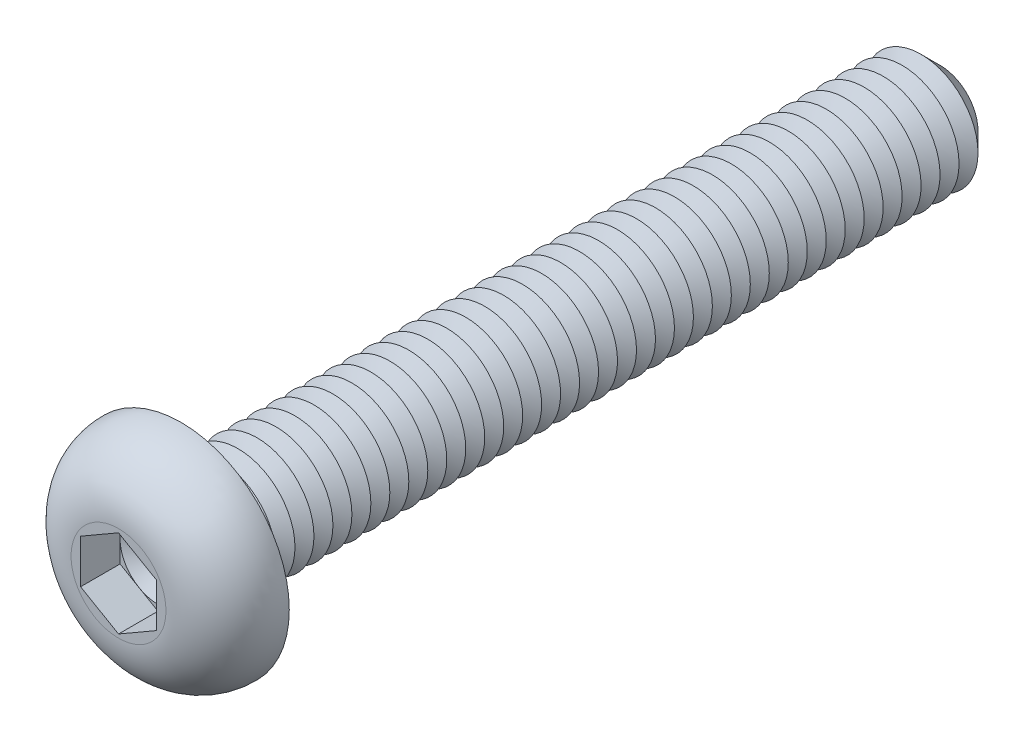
ISO-10303-21;
HEADER;
FILE_DESCRIPTION(('STEP AP214'),'2;1');
FILE_NAME('part.step','',(''),(''),'','','');
FILE_SCHEMA(('AUTOMOTIVE_DESIGN { 1 0 10303 214 1 1 1 1 }'));
ENDSEC;
DATA;
#1=APPLICATION_CONTEXT('core data for automotive mechanical design processes');
#2=APPLICATION_PROTOCOL_DEFINITION('international standard','automotive_design',2000,#1);
#3=PRODUCT_CONTEXT('',#1,'mechanical');
#4=PRODUCT('Part','Part','',(#3));
#5=PRODUCT_RELATED_PRODUCT_CATEGORY('part','',(#4));
#6=PRODUCT_DEFINITION_FORMATION('','',#4);
#7=PRODUCT_DEFINITION_CONTEXT('part definition',#1,'design');
#8=PRODUCT_DEFINITION('design','',#6,#7);
#9=PRODUCT_DEFINITION_SHAPE('','',#8);
#10=(LENGTH_UNIT() NAMED_UNIT(*) SI_UNIT(.MILLI.,.METRE.));
#11=(NAMED_UNIT(*) PLANE_ANGLE_UNIT() SI_UNIT($,.RADIAN.));
#12=(NAMED_UNIT(*) SI_UNIT($,.STERADIAN.) SOLID_ANGLE_UNIT());
#13=UNCERTAINTY_MEASURE_WITH_UNIT(LENGTH_MEASURE(1.E-05),#10,'distance_accuracy_value','');
#14=(GEOMETRIC_REPRESENTATION_CONTEXT(3) GLOBAL_UNCERTAINTY_ASSIGNED_CONTEXT((#13)) GLOBAL_UNIT_ASSIGNED_CONTEXT((#10,
#11,#12)) REPRESENTATION_CONTEXT('',''));
#15=CARTESIAN_POINT('',(0.,0.,0.));
#16=DIRECTION('',(0.,0.,1.));
#17=DIRECTION('',(1.,0.,0.));
#18=AXIS2_PLACEMENT_3D('',#15,#16,#17);
#19=CARTESIAN_POINT('',(0.,0.,0.61));
#20=DIRECTION('',(0.,0.,1.));
#21=DIRECTION('',(1.,0.,0.));
#22=AXIS2_PLACEMENT_3D('',#19,#20,#21);
#23=PLANE('',#22);
#24=CARTESIAN_POINT('',(0.,0.,0.61));
#25=DIRECTION('',(0.,0.,1.));
#26=DIRECTION('',(1.,0.,0.));
#27=AXIS2_PLACEMENT_3D('',#24,#25,#26);
#28=CIRCLE('',#27,1.);
#29=CARTESIAN_POINT('',(1.,0.,0.61));
#30=VERTEX_POINT('',#29);
#31=CARTESIAN_POINT('',(0.5,0.866025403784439,0.61));
#32=VERTEX_POINT('',#31);
#33=EDGE_CURVE('E117',#30,#32,#28,.T.);
#34=ORIENTED_EDGE('',*,*,#33,.F.);
#35=DIRECTION('',(0.,1.,0.));
#36=VECTOR('',#35,1.);
#37=CARTESIAN_POINT('',(1.,-0.577350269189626,0.61));
#38=LINE('',#37,#36);
#39=CARTESIAN_POINT('',(1.,0.577350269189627,0.61));
#40=VERTEX_POINT('',#39);
#41=EDGE_CURVE('E140',#30,#40,#38,.T.);
#42=ORIENTED_EDGE('',*,*,#41,.T.);
#43=DIRECTION('',(-0.866025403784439,0.5,0.));
#44=VECTOR('',#43,1.);
#45=CARTESIAN_POINT('',(1.,0.577350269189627,0.61));
#46=LINE('',#45,#44);
#47=EDGE_CURVE('E135',#40,#32,#46,.T.);
#48=ORIENTED_EDGE('',*,*,#47,.T.);
#49=EDGE_LOOP('',(#34,#42,#48));
#50=FACE_BOUND('',#49,.T.);
#51=ADVANCED_FACE('F39',(#50),#23,.T.);
#52=CARTESIAN_POINT('',(0.,0.,0.61));
#53=DIRECTION('',(0.,0.,1.));
#54=DIRECTION('',(1.,0.,0.));
#55=AXIS2_PLACEMENT_3D('',#52,#53,#54);
#56=CIRCLE('',#55,1.);
#57=CARTESIAN_POINT('',(-0.5,0.866025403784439,0.61));
#58=VERTEX_POINT('',#57);
#59=EDGE_CURVE('E11',#32,#58,#56,.T.);
#60=ORIENTED_EDGE('',*,*,#59,.F.);
#61=CARTESIAN_POINT('',(0.,1.15470053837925,0.61));
#62=VERTEX_POINT('',#61);
#63=EDGE_CURVE('E130',#32,#62,#46,.T.);
#64=ORIENTED_EDGE('',*,*,#63,.T.);
#65=DIRECTION('',(-0.866025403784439,-0.5,0.));
#66=VECTOR('',#65,1.);
#67=CARTESIAN_POINT('',(0.,1.15470053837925,0.61));
#68=LINE('',#67,#66);
#69=EDGE_CURVE('E132',#62,#58,#68,.T.);
#70=ORIENTED_EDGE('',*,*,#69,.T.);
#71=EDGE_LOOP('',(#60,#64,#70));
#72=FACE_BOUND('',#71,.T.);
#73=ADVANCED_FACE('F129',(#72),#23,.T.);
#74=CARTESIAN_POINT('',(-1.,0.,0.61));
#75=VERTEX_POINT('',#74);
#76=EDGE_CURVE('E49',#58,#75,#56,.T.);
#77=ORIENTED_EDGE('',*,*,#76,.F.);
#78=CARTESIAN_POINT('',(-1.,0.577350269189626,0.61));
#79=VERTEX_POINT('',#78);
#80=EDGE_CURVE('E143',#58,#79,#68,.T.);
#81=ORIENTED_EDGE('',*,*,#80,.T.);
#82=DIRECTION('',(0.,-1.,0.));
#83=VECTOR('',#82,1.);
#84=CARTESIAN_POINT('',(-1.,0.577350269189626,0.61));
#85=LINE('',#84,#83);
#86=EDGE_CURVE('E154',#79,#75,#85,.T.);
#87=ORIENTED_EDGE('',*,*,#86,.T.);
#88=EDGE_LOOP('',(#77,#81,#87));
#89=FACE_BOUND('',#88,.T.);
#90=ADVANCED_FACE('F249',(#89),#23,.T.);
#91=CARTESIAN_POINT('',(-0.5,-0.866025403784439,0.61));
#92=VERTEX_POINT('',#91);
#93=EDGE_CURVE('E233',#75,#92,#56,.T.);
#94=ORIENTED_EDGE('',*,*,#93,.F.);
#95=CARTESIAN_POINT('',(-1.,-0.577350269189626,0.61));
#96=VERTEX_POINT('',#95);
#97=EDGE_CURVE('E153',#75,#96,#85,.T.);
#98=ORIENTED_EDGE('',*,*,#97,.T.);
#99=DIRECTION('',(0.866025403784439,-0.5,0.));
#100=VECTOR('',#99,1.);
#101=CARTESIAN_POINT('',(-1.,-0.577350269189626,0.61));
#102=LINE('',#101,#100);
#103=EDGE_CURVE('E159',#96,#92,#102,.T.);
#104=ORIENTED_EDGE('',*,*,#103,.T.);
#105=EDGE_LOOP('',(#94,#98,#104));
#106=FACE_BOUND('',#105,.T.);
#107=ADVANCED_FACE('F243',(#106),#23,.T.);
#108=CARTESIAN_POINT('',(0.5,-0.866025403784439,0.61));
#109=VERTEX_POINT('',#108);
#110=EDGE_CURVE('E56',#92,#109,#56,.T.);
#111=ORIENTED_EDGE('',*,*,#110,.F.);
#112=CARTESIAN_POINT('',(0.,-1.15470053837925,0.61));
#113=VERTEX_POINT('',#112);
#114=EDGE_CURVE('E158',#92,#113,#102,.T.);
#115=ORIENTED_EDGE('',*,*,#114,.T.);
#116=DIRECTION('',(0.866025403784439,0.5,0.));
#117=VECTOR('',#116,1.);
#118=CARTESIAN_POINT('',(0.,-1.15470053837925,0.61));
#119=LINE('',#118,#117);
#120=EDGE_CURVE('E164',#113,#109,#119,.T.);
#121=ORIENTED_EDGE('',*,*,#120,.T.);
#122=EDGE_LOOP('',(#111,#115,#121));
#123=FACE_BOUND('',#122,.T.);
#124=ADVANCED_FACE('F591',(#123),#23,.T.);
#125=CARTESIAN_POINT('',(0.,0.,-20.));
#126=DIRECTION('',(0.,0.,1.));
#127=DIRECTION('',(1.,0.,0.));
#128=AXIS2_PLACEMENT_3D('',#125,#126,#127);
#129=CYLINDRICAL_SURFACE('',#128,1.5);
#130=CARTESIAN_POINT('',(0.,0.,-0.199999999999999));
#131=DIRECTION('',(0.,0.,1.));
#132=DIRECTION('',(1.,0.,0.));
#133=AXIS2_PLACEMENT_3D('',#130,#131,#132);
#134=CIRCLE('',#133,1.5);
#135=CARTESIAN_POINT('',(1.5,0.,-0.199999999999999));
#136=VERTEX_POINT('',#135);
#137=EDGE_CURVE('E221',#136,#136,#134,.F.);
#138=ORIENTED_EDGE('',*,*,#137,.T.);
#139=EDGE_LOOP('',(#138));
#140=FACE_BOUND('',#139,.T.);
#141=CARTESIAN_POINT('',(0.,0.,-0.5));
#142=DIRECTION('',(0.,0.,1.));
#143=DIRECTION('',(1.,0.,0.));
#144=AXIS2_PLACEMENT_3D('',#141,#142,#143);
#145=CIRCLE('',#144,1.50000000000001);
#146=CARTESIAN_POINT('',(1.50000000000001,0.,-0.5));
#147=VERTEX_POINT('',#146);
#148=EDGE_CURVE('E149',#147,#147,#145,.T.);
#149=ORIENTED_EDGE('',*,*,#148,.T.);
#150=EDGE_LOOP('',(#149));
#151=FACE_BOUND('',#150,.T.);
#152=ADVANCED_FACE('F575',(#140,#151),#129,.T.);
#153=CARTESIAN_POINT('',(0.,2.85,0.));
#154=DIRECTION('',(0.,0.,1.));
#155=DIRECTION('',(1.,0.,0.));
#156=AXIS2_PLACEMENT_3D('',#153,#154,#155);
#157=PLANE('',#156);
#158=CARTESIAN_POINT('',(0.,0.,0.));
#159=DIRECTION('',(0.,0.,1.));
#160=DIRECTION('',(1.,0.,0.));
#161=AXIS2_PLACEMENT_3D('',#158,#159,#160);
#162=CIRCLE('',#161,1.7);
#163=CARTESIAN_POINT('',(1.7,0.,0.));
#164=VERTEX_POINT('',#163);
#165=EDGE_CURVE('E224',#164,#164,#162,.T.);
#166=ORIENTED_EDGE('',*,*,#165,.T.);
#167=EDGE_LOOP('',(#166));
#168=FACE_BOUND('',#167,.T.);
#169=CARTESIAN_POINT('',(0.,0.,0.));
#170=DIRECTION('',(0.,0.,1.));
#171=DIRECTION('',(1.,0.,0.));
#172=AXIS2_PLACEMENT_3D('',#169,#170,#171);
#173=CIRCLE('',#172,2.85);
#174=CARTESIAN_POINT('',(2.85,0.,0.));
#175=VERTEX_POINT('',#174);
#176=EDGE_CURVE('E195',#175,#175,#173,.T.);
#177=ORIENTED_EDGE('',*,*,#176,.F.);
#178=EDGE_LOOP('',(#177));
#179=FACE_BOUND('',#178,.T.);
#180=ADVANCED_FACE('F621',(#168,#179),#157,.F.);
#181=CARTESIAN_POINT('',(0.,0.,1.65));
#182=DIRECTION('',(0.,0.,-1.));
#183=DIRECTION('',(-1.,0.,0.));
#184=AXIS2_PLACEMENT_3D('',#181,#182,#183);
#185=PLANE('',#184);
#186=DIRECTION('',(-0.866025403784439,-0.5,0.));
#187=VECTOR('',#186,1.);
#188=CARTESIAN_POINT('',(0.,1.15470053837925,1.65));
#189=LINE('',#188,#187);
#190=CARTESIAN_POINT('',(0.,1.15470053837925,1.65));
#191=VERTEX_POINT('',#190);
#192=CARTESIAN_POINT('',(-1.,0.577350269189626,1.65));
#193=VERTEX_POINT('',#192);
#194=EDGE_CURVE('E174',#191,#193,#189,.T.);
#195=ORIENTED_EDGE('',*,*,#194,.F.);
#196=DIRECTION('',(-0.866025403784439,0.5,0.));
#197=VECTOR('',#196,1.);
#198=CARTESIAN_POINT('',(1.,0.577350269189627,1.65));
#199=LINE('',#198,#197);
#200=CARTESIAN_POINT('',(1.,0.577350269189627,1.65));
#201=VERTEX_POINT('',#200);
#202=EDGE_CURVE('E64',#201,#191,#199,.T.);
#203=ORIENTED_EDGE('',*,*,#202,.F.);
#204=DIRECTION('',(0.,1.,0.));
#205=VECTOR('',#204,1.);
#206=CARTESIAN_POINT('',(1.,-0.577350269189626,1.65));
#207=LINE('',#206,#205);
#208=CARTESIAN_POINT('',(1.,-0.577350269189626,1.65));
#209=VERTEX_POINT('',#208);
#210=EDGE_CURVE('E138',#209,#201,#207,.T.);
#211=ORIENTED_EDGE('',*,*,#210,.F.);
#212=DIRECTION('',(0.866025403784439,0.5,0.));
#213=VECTOR('',#212,1.);
#214=CARTESIAN_POINT('',(0.,-1.15470053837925,1.65));
#215=LINE('',#214,#213);
#216=CARTESIAN_POINT('',(0.,-1.15470053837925,1.65));
#217=VERTEX_POINT('',#216);
#218=EDGE_CURVE('E185',#217,#209,#215,.T.);
#219=ORIENTED_EDGE('',*,*,#218,.F.);
#220=DIRECTION('',(0.866025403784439,-0.5,0.));
#221=VECTOR('',#220,1.);
#222=CARTESIAN_POINT('',(-1.,-0.577350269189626,1.65));
#223=LINE('',#222,#221);
#224=CARTESIAN_POINT('',(-1.,-0.577350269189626,1.65));
#225=VERTEX_POINT('',#224);
#226=EDGE_CURVE('E181',#225,#217,#223,.T.);
#227=ORIENTED_EDGE('',*,*,#226,.F.);
#228=DIRECTION('',(0.,-1.,0.));
#229=VECTOR('',#228,1.);
#230=CARTESIAN_POINT('',(-1.,0.577350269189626,1.65));
#231=LINE('',#230,#229);
#232=EDGE_CURVE('E177',#193,#225,#231,.T.);
#233=ORIENTED_EDGE('',*,*,#232,.F.);
#234=EDGE_LOOP('',(#195,#203,#211,#219,#227,#233));
#235=FACE_BOUND('',#234,.T.);
#236=CARTESIAN_POINT('',(0.,0.,1.65));
#237=DIRECTION('',(0.,0.,1.));
#238=DIRECTION('',(1.,0.,0.));
#239=AXIS2_PLACEMENT_3D('',#236,#237,#238);
#240=CIRCLE('',#239,1.25078144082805);
#241=CARTESIAN_POINT('',(1.25078144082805,0.,1.65));
#242=VERTEX_POINT('',#241);
#243=EDGE_CURVE('E213',#242,#242,#240,.T.);
#244=ORIENTED_EDGE('',*,*,#243,.T.);
#245=EDGE_LOOP('',(#244));
#246=FACE_BOUND('',#245,.T.);
#247=ADVANCED_FACE('F258',(#235,#246),#185,.F.);
#248=CARTESIAN_POINT('',(0.,0.,0.0499999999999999));
#249=DIRECTION('',(0.,0.,1.));
#250=DIRECTION('',(1.,0.,0.));
#251=AXIS2_PLACEMENT_3D('',#248,#249,#250);
#252=DEGENERATE_TOROIDAL_SURFACE('',#251,1.25078144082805,1.6,.T.);
#253=ORIENTED_EDGE('',*,*,#243,.F.);
#254=EDGE_LOOP('',(#253));
#255=FACE_BOUND('',#254,.T.);
#256=ORIENTED_EDGE('',*,*,#176,.T.);
#257=EDGE_LOOP('',(#256));
#258=FACE_BOUND('',#257,.T.);
#259=ADVANCED_FACE('F615',(#255,#258),#252,.T.);
#260=CARTESIAN_POINT('',(1.,0.577350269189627,0.61));
#261=DIRECTION('',(0.5,0.866025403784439,0.));
#262=DIRECTION('',(-0.866025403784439,0.5,0.));
#263=AXIS2_PLACEMENT_3D('',#260,#261,#262);
#264=PLANE('',#263);
#265=ORIENTED_EDGE('',*,*,#202,.T.);
#266=DIRECTION('',(0.,0.,1.));
#267=VECTOR('',#266,1.);
#268=CARTESIAN_POINT('',(0.,1.15470053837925,0.61));
#269=LINE('',#268,#267);
#270=EDGE_CURVE('E136',#62,#191,#269,.T.);
#271=ORIENTED_EDGE('',*,*,#270,.F.);
#272=ORIENTED_EDGE('',*,*,#63,.F.);
#273=ORIENTED_EDGE('',*,*,#47,.F.);
#274=DIRECTION('',(0.,0.,1.));
#275=VECTOR('',#274,1.);
#276=CARTESIAN_POINT('',(1.,0.577350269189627,0.61));
#277=LINE('',#276,#275);
#278=EDGE_CURVE('E192',#40,#201,#277,.T.);
#279=ORIENTED_EDGE('',*,*,#278,.T.);
#280=EDGE_LOOP('',(#265,#271,#272,#273,#279));
#281=FACE_BOUND('',#280,.T.);
#282=ADVANCED_FACE('F134',(#281),#264,.F.);
#283=CARTESIAN_POINT('',(1.,-0.577350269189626,0.61));
#284=DIRECTION('',(1.,0.,0.));
#285=DIRECTION('',(0.,0.,-1.));
#286=AXIS2_PLACEMENT_3D('',#283,#284,#285);
#287=PLANE('',#286);
#288=ORIENTED_EDGE('',*,*,#210,.T.);
#289=ORIENTED_EDGE('',*,*,#278,.F.);
#290=ORIENTED_EDGE('',*,*,#41,.F.);
#291=CARTESIAN_POINT('',(1.,-0.577350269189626,0.61));
#292=VERTEX_POINT('',#291);
#293=EDGE_CURVE('E168',#292,#30,#38,.T.);
#294=ORIENTED_EDGE('',*,*,#293,.F.);
#295=DIRECTION('',(0.,0.,1.));
#296=VECTOR('',#295,1.);
#297=CARTESIAN_POINT('',(1.,-0.577350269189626,0.61));
#298=LINE('',#297,#296);
#299=EDGE_CURVE('E196',#292,#209,#298,.T.);
#300=ORIENTED_EDGE('',*,*,#299,.T.);
#301=EDGE_LOOP('',(#288,#289,#290,#294,#300));
#302=FACE_BOUND('',#301,.T.);
#303=ADVANCED_FACE('F599',(#302),#287,.F.);
#304=CARTESIAN_POINT('',(0.,-1.15470053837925,0.61));
#305=DIRECTION('',(0.5,-0.866025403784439,0.));
#306=DIRECTION('',(0.866025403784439,0.5,0.));
#307=AXIS2_PLACEMENT_3D('',#304,#305,#306);
#308=PLANE('',#307);
#309=ORIENTED_EDGE('',*,*,#218,.T.);
#310=ORIENTED_EDGE('',*,*,#299,.F.);
#311=EDGE_CURVE('E163',#109,#292,#119,.T.);
#312=ORIENTED_EDGE('',*,*,#311,.F.);
#313=ORIENTED_EDGE('',*,*,#120,.F.);
#314=DIRECTION('',(0.,0.,1.));
#315=VECTOR('',#314,1.);
#316=CARTESIAN_POINT('',(0.,-1.15470053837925,0.61));
#317=LINE('',#316,#315);
#318=EDGE_CURVE('E199',#113,#217,#317,.T.);
#319=ORIENTED_EDGE('',*,*,#318,.T.);
#320=EDGE_LOOP('',(#309,#310,#312,#313,#319));
#321=FACE_BOUND('',#320,.T.);
#322=ADVANCED_FACE('F602',(#321),#308,.F.);
#323=CARTESIAN_POINT('',(-1.,-0.577350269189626,0.61));
#324=DIRECTION('',(-0.5,-0.866025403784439,0.));
#325=DIRECTION('',(0.866025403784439,-0.5,0.));
#326=AXIS2_PLACEMENT_3D('',#323,#324,#325);
#327=PLANE('',#326);
#328=ORIENTED_EDGE('',*,*,#226,.T.);
#329=ORIENTED_EDGE('',*,*,#318,.F.);
#330=ORIENTED_EDGE('',*,*,#114,.F.);
#331=ORIENTED_EDGE('',*,*,#103,.F.);
#332=DIRECTION('',(0.,0.,1.));
#333=VECTOR('',#332,1.);
#334=CARTESIAN_POINT('',(-1.,-0.577350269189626,0.61));
#335=LINE('',#334,#333);
#336=EDGE_CURVE('E202',#96,#225,#335,.T.);
#337=ORIENTED_EDGE('',*,*,#336,.T.);
#338=EDGE_LOOP('',(#328,#329,#330,#331,#337));
#339=FACE_BOUND('',#338,.T.);
#340=ADVANCED_FACE('F263',(#339),#327,.F.);
#341=CARTESIAN_POINT('',(-1.,0.577350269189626,0.61));
#342=DIRECTION('',(-1.,0.,0.));
#343=DIRECTION('',(0.,-1.,0.));
#344=AXIS2_PLACEMENT_3D('',#341,#342,#343);
#345=PLANE('',#344);
#346=ORIENTED_EDGE('',*,*,#232,.T.);
#347=ORIENTED_EDGE('',*,*,#336,.F.);
#348=ORIENTED_EDGE('',*,*,#97,.F.);
#349=ORIENTED_EDGE('',*,*,#86,.F.);
#350=DIRECTION('',(0.,0.,1.));
#351=VECTOR('',#350,1.);
#352=CARTESIAN_POINT('',(-1.,0.577350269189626,0.61));
#353=LINE('',#352,#351);
#354=EDGE_CURVE('E205',#79,#193,#353,.T.);
#355=ORIENTED_EDGE('',*,*,#354,.T.);
#356=EDGE_LOOP('',(#346,#347,#348,#349,#355));
#357=FACE_BOUND('',#356,.T.);
#358=ADVANCED_FACE('F248',(#357),#345,.F.);
#359=CARTESIAN_POINT('',(0.,1.15470053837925,0.61));
#360=DIRECTION('',(-0.5,0.866025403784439,0.));
#361=DIRECTION('',(-0.866025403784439,-0.5,0.));
#362=AXIS2_PLACEMENT_3D('',#359,#360,#361);
#363=PLANE('',#362);
#364=ORIENTED_EDGE('',*,*,#194,.T.);
#365=ORIENTED_EDGE('',*,*,#354,.F.);
#366=ORIENTED_EDGE('',*,*,#80,.F.);
#367=ORIENTED_EDGE('',*,*,#69,.F.);
#368=ORIENTED_EDGE('',*,*,#270,.T.);
#369=EDGE_LOOP('',(#364,#365,#366,#367,#368));
#370=FACE_BOUND('',#369,.T.);
#371=ADVANCED_FACE('F252',(#370),#363,.F.);
#372=EDGE_CURVE('E43',#109,#30,#56,.T.);
#373=ORIENTED_EDGE('',*,*,#372,.F.);
#374=ORIENTED_EDGE('',*,*,#311,.T.);
#375=ORIENTED_EDGE('',*,*,#293,.T.);
#376=EDGE_LOOP('',(#373,#374,#375));
#377=FACE_BOUND('',#376,.T.);
#378=ADVANCED_FACE('F580',(#377),#23,.T.);
#379=CARTESIAN_POINT('',(0.,0.,-0.5));
#380=DIRECTION('',(0.,0.,1.));
#381=DIRECTION('',(1.,0.,0.));
#382=AXIS2_PLACEMENT_3D('',#379,#380,#381);
#383=CONICAL_SURFACE('',#382,1.50000000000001,1.0471975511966);
#384=CARTESIAN_POINT('',(0.,0.,-0.750000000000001));
#385=DIRECTION('',(0.,0.,1.));
#386=DIRECTION('',(1.,0.,0.));
#387=AXIS2_PLACEMENT_3D('',#384,#385,#386);
#388=CIRCLE('',#387,1.06698729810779);
#389=CARTESIAN_POINT('',(1.06698729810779,0.,-0.750000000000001));
#390=VERTEX_POINT('',#389);
#391=EDGE_CURVE('E565',#390,#390,#388,.T.);
#392=ORIENTED_EDGE('',*,*,#391,.T.);
#393=EDGE_LOOP('',(#392));
#394=FACE_BOUND('',#393,.T.);
#395=ORIENTED_EDGE('',*,*,#148,.F.);
#396=EDGE_LOOP('',(#395));
#397=FACE_BOUND('',#396,.T.);
#398=ADVANCED_FACE('F577',(#394,#397),#383,.T.);
#399=CARTESIAN_POINT('',(0.,0.,-0.750000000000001));
#400=DIRECTION('',(0.,0.,-1.));
#401=DIRECTION('',(-1.,0.,0.));
#402=AXIS2_PLACEMENT_3D('',#399,#400,#401);
#403=CONICAL_SURFACE('',#402,1.06698729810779,1.0471975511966);
#404=CARTESIAN_POINT('',(0.,0.,-1.));
#405=DIRECTION('',(0.,0.,1.));
#406=DIRECTION('',(1.,0.,0.));
#407=AXIS2_PLACEMENT_3D('',#404,#405,#406);
#408=CIRCLE('',#407,1.50000000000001);
#409=CARTESIAN_POINT('',(1.50000000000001,0.,-1.));
#410=VERTEX_POINT('',#409);
#411=EDGE_CURVE('E562',#410,#410,#408,.T.);
#412=ORIENTED_EDGE('',*,*,#411,.T.);
#413=EDGE_LOOP('',(#412));
#414=FACE_BOUND('',#413,.T.);
#415=ORIENTED_EDGE('',*,*,#391,.F.);
#416=EDGE_LOOP('',(#415));
#417=FACE_BOUND('',#416,.T.);
#418=ADVANCED_FACE('F579',(#414,#417),#403,.T.);
#419=CARTESIAN_POINT('',(0.,0.,-1.));
#420=DIRECTION('',(0.,0.,1.));
#421=DIRECTION('',(1.,0.,0.));
#422=AXIS2_PLACEMENT_3D('',#419,#420,#421);
#423=CONICAL_SURFACE('',#422,1.50000000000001,1.0471975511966);
#424=CARTESIAN_POINT('',(0.,0.,-1.25));
#425=DIRECTION('',(0.,0.,1.));
#426=DIRECTION('',(1.,0.,0.));
#427=AXIS2_PLACEMENT_3D('',#424,#425,#426);
#428=CIRCLE('',#427,1.06698729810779);
#429=CARTESIAN_POINT('',(1.06698729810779,0.,-1.25));
#430=VERTEX_POINT('',#429);
#431=EDGE_CURVE('E558',#430,#430,#428,.T.);
#432=ORIENTED_EDGE('',*,*,#431,.T.);
#433=EDGE_LOOP('',(#432));
#434=FACE_BOUND('',#433,.T.);
#435=ORIENTED_EDGE('',*,*,#411,.F.);
#436=EDGE_LOOP('',(#435));
#437=FACE_BOUND('',#436,.T.);
#438=ADVANCED_FACE('F586',(#434,#437),#423,.T.);
#439=CARTESIAN_POINT('',(0.,0.,-1.25));
#440=DIRECTION('',(0.,0.,-1.));
#441=DIRECTION('',(-1.,0.,0.));
#442=AXIS2_PLACEMENT_3D('',#439,#440,#441);
#443=CONICAL_SURFACE('',#442,1.06698729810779,1.0471975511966);
#444=CARTESIAN_POINT('',(0.,0.,-1.5));
#445=DIRECTION('',(0.,0.,1.));
#446=DIRECTION('',(1.,0.,0.));
#447=AXIS2_PLACEMENT_3D('',#444,#445,#446);
#448=CIRCLE('',#447,1.50000000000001);
#449=CARTESIAN_POINT('',(1.50000000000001,0.,-1.5));
#450=VERTEX_POINT('',#449);
#451=EDGE_CURVE('E554',#450,#450,#448,.T.);
#452=ORIENTED_EDGE('',*,*,#451,.T.);
#453=EDGE_LOOP('',(#452));
#454=FACE_BOUND('',#453,.T.);
#455=ORIENTED_EDGE('',*,*,#431,.F.);
#456=EDGE_LOOP('',(#455));
#457=FACE_BOUND('',#456,.T.);
#458=ADVANCED_FACE('F927',(#454,#457),#443,.T.);
#459=CARTESIAN_POINT('',(0.,0.,-1.5));
#460=DIRECTION('',(0.,0.,1.));
#461=DIRECTION('',(1.,0.,0.));
#462=AXIS2_PLACEMENT_3D('',#459,#460,#461);
#463=CONICAL_SURFACE('',#462,1.50000000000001,1.0471975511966);
#464=CARTESIAN_POINT('',(0.,0.,-1.75));
#465=DIRECTION('',(0.,0.,1.));
#466=DIRECTION('',(1.,0.,0.));
#467=AXIS2_PLACEMENT_3D('',#464,#465,#466);
#468=CIRCLE('',#467,1.06698729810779);
#469=CARTESIAN_POINT('',(1.06698729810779,0.,-1.75));
#470=VERTEX_POINT('',#469);
#471=EDGE_CURVE('E550',#470,#470,#468,.T.);
#472=ORIENTED_EDGE('',*,*,#471,.T.);
#473=EDGE_LOOP('',(#472));
#474=FACE_BOUND('',#473,.T.);
#475=ORIENTED_EDGE('',*,*,#451,.F.);
#476=EDGE_LOOP('',(#475));
#477=FACE_BOUND('',#476,.T.);
#478=ADVANCED_FACE('F923',(#474,#477),#463,.T.);
#479=CARTESIAN_POINT('',(0.,0.,-1.75));
#480=DIRECTION('',(0.,0.,-1.));
#481=DIRECTION('',(-1.,0.,0.));
#482=AXIS2_PLACEMENT_3D('',#479,#480,#481);
#483=CONICAL_SURFACE('',#482,1.06698729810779,1.0471975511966);
#484=CARTESIAN_POINT('',(0.,0.,-2.));
#485=DIRECTION('',(0.,0.,1.));
#486=DIRECTION('',(1.,0.,0.));
#487=AXIS2_PLACEMENT_3D('',#484,#485,#486);
#488=CIRCLE('',#487,1.50000000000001);
#489=CARTESIAN_POINT('',(1.50000000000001,0.,-2.));
#490=VERTEX_POINT('',#489);
#491=EDGE_CURVE('E546',#490,#490,#488,.T.);
#492=ORIENTED_EDGE('',*,*,#491,.T.);
#493=EDGE_LOOP('',(#492));
#494=FACE_BOUND('',#493,.T.);
#495=ORIENTED_EDGE('',*,*,#471,.F.);
#496=EDGE_LOOP('',(#495));
#497=FACE_BOUND('',#496,.T.);
#498=ADVANCED_FACE('F919',(#494,#497),#483,.T.);
#499=CARTESIAN_POINT('',(0.,0.,-2.));
#500=DIRECTION('',(0.,0.,1.));
#501=DIRECTION('',(1.,0.,0.));
#502=AXIS2_PLACEMENT_3D('',#499,#500,#501);
#503=CONICAL_SURFACE('',#502,1.50000000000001,1.0471975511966);
#504=CARTESIAN_POINT('',(0.,0.,-2.25));
#505=DIRECTION('',(0.,0.,1.));
#506=DIRECTION('',(1.,0.,0.));
#507=AXIS2_PLACEMENT_3D('',#504,#505,#506);
#508=CIRCLE('',#507,1.06698729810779);
#509=CARTESIAN_POINT('',(1.06698729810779,0.,-2.25));
#510=VERTEX_POINT('',#509);
#511=EDGE_CURVE('E542',#510,#510,#508,.T.);
#512=ORIENTED_EDGE('',*,*,#511,.T.);
#513=EDGE_LOOP('',(#512));
#514=FACE_BOUND('',#513,.T.);
#515=ORIENTED_EDGE('',*,*,#491,.F.);
#516=EDGE_LOOP('',(#515));
#517=FACE_BOUND('',#516,.T.);
#518=ADVANCED_FACE('F915',(#514,#517),#503,.T.);
#519=CARTESIAN_POINT('',(0.,0.,-2.25));
#520=DIRECTION('',(0.,0.,-1.));
#521=DIRECTION('',(-1.,0.,0.));
#522=AXIS2_PLACEMENT_3D('',#519,#520,#521);
#523=CONICAL_SURFACE('',#522,1.06698729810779,1.0471975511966);
#524=CARTESIAN_POINT('',(0.,0.,-2.5));
#525=DIRECTION('',(0.,0.,1.));
#526=DIRECTION('',(1.,0.,0.));
#527=AXIS2_PLACEMENT_3D('',#524,#525,#526);
#528=CIRCLE('',#527,1.50000000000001);
#529=CARTESIAN_POINT('',(1.50000000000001,0.,-2.5));
#530=VERTEX_POINT('',#529);
#531=EDGE_CURVE('E538',#530,#530,#528,.T.);
#532=ORIENTED_EDGE('',*,*,#531,.T.);
#533=EDGE_LOOP('',(#532));
#534=FACE_BOUND('',#533,.T.);
#535=ORIENTED_EDGE('',*,*,#511,.F.);
#536=EDGE_LOOP('',(#535));
#537=FACE_BOUND('',#536,.T.);
#538=ADVANCED_FACE('F911',(#534,#537),#523,.T.);
#539=CARTESIAN_POINT('',(0.,0.,-2.5));
#540=DIRECTION('',(0.,0.,1.));
#541=DIRECTION('',(1.,0.,0.));
#542=AXIS2_PLACEMENT_3D('',#539,#540,#541);
#543=CONICAL_SURFACE('',#542,1.50000000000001,1.0471975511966);
#544=CARTESIAN_POINT('',(0.,0.,-2.75));
#545=DIRECTION('',(0.,0.,1.));
#546=DIRECTION('',(1.,0.,0.));
#547=AXIS2_PLACEMENT_3D('',#544,#545,#546);
#548=CIRCLE('',#547,1.06698729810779);
#549=CARTESIAN_POINT('',(1.06698729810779,0.,-2.75));
#550=VERTEX_POINT('',#549);
#551=EDGE_CURVE('E534',#550,#550,#548,.T.);
#552=ORIENTED_EDGE('',*,*,#551,.T.);
#553=EDGE_LOOP('',(#552));
#554=FACE_BOUND('',#553,.T.);
#555=ORIENTED_EDGE('',*,*,#531,.F.);
#556=EDGE_LOOP('',(#555));
#557=FACE_BOUND('',#556,.T.);
#558=ADVANCED_FACE('F907',(#554,#557),#543,.T.);
#559=CARTESIAN_POINT('',(0.,0.,-2.75));
#560=DIRECTION('',(0.,0.,-1.));
#561=DIRECTION('',(-1.,0.,0.));
#562=AXIS2_PLACEMENT_3D('',#559,#560,#561);
#563=CONICAL_SURFACE('',#562,1.06698729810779,1.0471975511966);
#564=CARTESIAN_POINT('',(0.,0.,-3.));
#565=DIRECTION('',(0.,0.,1.));
#566=DIRECTION('',(1.,0.,0.));
#567=AXIS2_PLACEMENT_3D('',#564,#565,#566);
#568=CIRCLE('',#567,1.50000000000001);
#569=CARTESIAN_POINT('',(1.50000000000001,0.,-3.));
#570=VERTEX_POINT('',#569);
#571=EDGE_CURVE('E530',#570,#570,#568,.T.);
#572=ORIENTED_EDGE('',*,*,#571,.T.);
#573=EDGE_LOOP('',(#572));
#574=FACE_BOUND('',#573,.T.);
#575=ORIENTED_EDGE('',*,*,#551,.F.);
#576=EDGE_LOOP('',(#575));
#577=FACE_BOUND('',#576,.T.);
#578=ADVANCED_FACE('F903',(#574,#577),#563,.T.);
#579=CARTESIAN_POINT('',(0.,0.,-3.));
#580=DIRECTION('',(0.,0.,1.));
#581=DIRECTION('',(1.,0.,0.));
#582=AXIS2_PLACEMENT_3D('',#579,#580,#581);
#583=CONICAL_SURFACE('',#582,1.50000000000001,1.0471975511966);
#584=CARTESIAN_POINT('',(0.,0.,-3.25));
#585=DIRECTION('',(0.,0.,1.));
#586=DIRECTION('',(1.,0.,0.));
#587=AXIS2_PLACEMENT_3D('',#584,#585,#586);
#588=CIRCLE('',#587,1.06698729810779);
#589=CARTESIAN_POINT('',(1.06698729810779,0.,-3.25));
#590=VERTEX_POINT('',#589);
#591=EDGE_CURVE('E526',#590,#590,#588,.T.);
#592=ORIENTED_EDGE('',*,*,#591,.T.);
#593=EDGE_LOOP('',(#592));
#594=FACE_BOUND('',#593,.T.);
#595=ORIENTED_EDGE('',*,*,#571,.F.);
#596=EDGE_LOOP('',(#595));
#597=FACE_BOUND('',#596,.T.);
#598=ADVANCED_FACE('F899',(#594,#597),#583,.T.);
#599=CARTESIAN_POINT('',(0.,0.,-3.25));
#600=DIRECTION('',(0.,0.,-1.));
#601=DIRECTION('',(-1.,0.,0.));
#602=AXIS2_PLACEMENT_3D('',#599,#600,#601);
#603=CONICAL_SURFACE('',#602,1.06698729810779,1.0471975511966);
#604=CARTESIAN_POINT('',(0.,0.,-3.5));
#605=DIRECTION('',(0.,0.,1.));
#606=DIRECTION('',(1.,0.,0.));
#607=AXIS2_PLACEMENT_3D('',#604,#605,#606);
#608=CIRCLE('',#607,1.50000000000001);
#609=CARTESIAN_POINT('',(1.50000000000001,0.,-3.5));
#610=VERTEX_POINT('',#609);
#611=EDGE_CURVE('E522',#610,#610,#608,.T.);
#612=ORIENTED_EDGE('',*,*,#611,.T.);
#613=EDGE_LOOP('',(#612));
#614=FACE_BOUND('',#613,.T.);
#615=ORIENTED_EDGE('',*,*,#591,.F.);
#616=EDGE_LOOP('',(#615));
#617=FACE_BOUND('',#616,.T.);
#618=ADVANCED_FACE('F895',(#614,#617),#603,.T.);
#619=CARTESIAN_POINT('',(0.,0.,-3.5));
#620=DIRECTION('',(0.,0.,1.));
#621=DIRECTION('',(1.,0.,0.));
#622=AXIS2_PLACEMENT_3D('',#619,#620,#621);
#623=CONICAL_SURFACE('',#622,1.50000000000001,1.0471975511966);
#624=CARTESIAN_POINT('',(0.,0.,-3.75));
#625=DIRECTION('',(0.,0.,1.));
#626=DIRECTION('',(1.,0.,0.));
#627=AXIS2_PLACEMENT_3D('',#624,#625,#626);
#628=CIRCLE('',#627,1.06698729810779);
#629=CARTESIAN_POINT('',(1.06698729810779,0.,-3.75));
#630=VERTEX_POINT('',#629);
#631=EDGE_CURVE('E518',#630,#630,#628,.T.);
#632=ORIENTED_EDGE('',*,*,#631,.T.);
#633=EDGE_LOOP('',(#632));
#634=FACE_BOUND('',#633,.T.);
#635=ORIENTED_EDGE('',*,*,#611,.F.);
#636=EDGE_LOOP('',(#635));
#637=FACE_BOUND('',#636,.T.);
#638=ADVANCED_FACE('F891',(#634,#637),#623,.T.);
#639=CARTESIAN_POINT('',(0.,0.,-3.75));
#640=DIRECTION('',(0.,0.,-1.));
#641=DIRECTION('',(-1.,0.,0.));
#642=AXIS2_PLACEMENT_3D('',#639,#640,#641);
#643=CONICAL_SURFACE('',#642,1.06698729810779,1.0471975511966);
#644=CARTESIAN_POINT('',(0.,0.,-4.));
#645=DIRECTION('',(0.,0.,1.));
#646=DIRECTION('',(1.,0.,0.));
#647=AXIS2_PLACEMENT_3D('',#644,#645,#646);
#648=CIRCLE('',#647,1.50000000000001);
#649=CARTESIAN_POINT('',(1.50000000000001,0.,-4.));
#650=VERTEX_POINT('',#649);
#651=EDGE_CURVE('E514',#650,#650,#648,.T.);
#652=ORIENTED_EDGE('',*,*,#651,.T.);
#653=EDGE_LOOP('',(#652));
#654=FACE_BOUND('',#653,.T.);
#655=ORIENTED_EDGE('',*,*,#631,.F.);
#656=EDGE_LOOP('',(#655));
#657=FACE_BOUND('',#656,.T.);
#658=ADVANCED_FACE('F887',(#654,#657),#643,.T.);
#659=CARTESIAN_POINT('',(0.,0.,-4.));
#660=DIRECTION('',(0.,0.,1.));
#661=DIRECTION('',(1.,0.,0.));
#662=AXIS2_PLACEMENT_3D('',#659,#660,#661);
#663=CONICAL_SURFACE('',#662,1.50000000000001,1.0471975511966);
#664=CARTESIAN_POINT('',(0.,0.,-4.25));
#665=DIRECTION('',(0.,0.,1.));
#666=DIRECTION('',(1.,0.,0.));
#667=AXIS2_PLACEMENT_3D('',#664,#665,#666);
#668=CIRCLE('',#667,1.06698729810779);
#669=CARTESIAN_POINT('',(1.06698729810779,0.,-4.25));
#670=VERTEX_POINT('',#669);
#671=EDGE_CURVE('E510',#670,#670,#668,.T.);
#672=ORIENTED_EDGE('',*,*,#671,.T.);
#673=EDGE_LOOP('',(#672));
#674=FACE_BOUND('',#673,.T.);
#675=ORIENTED_EDGE('',*,*,#651,.F.);
#676=EDGE_LOOP('',(#675));
#677=FACE_BOUND('',#676,.T.);
#678=ADVANCED_FACE('F883',(#674,#677),#663,.T.);
#679=CARTESIAN_POINT('',(0.,0.,-4.25));
#680=DIRECTION('',(0.,0.,-1.));
#681=DIRECTION('',(-1.,0.,0.));
#682=AXIS2_PLACEMENT_3D('',#679,#680,#681);
#683=CONICAL_SURFACE('',#682,1.06698729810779,1.0471975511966);
#684=CARTESIAN_POINT('',(0.,0.,-4.5));
#685=DIRECTION('',(0.,0.,1.));
#686=DIRECTION('',(1.,0.,0.));
#687=AXIS2_PLACEMENT_3D('',#684,#685,#686);
#688=CIRCLE('',#687,1.50000000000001);
#689=CARTESIAN_POINT('',(1.50000000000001,0.,-4.5));
#690=VERTEX_POINT('',#689);
#691=EDGE_CURVE('E506',#690,#690,#688,.T.);
#692=ORIENTED_EDGE('',*,*,#691,.T.);
#693=EDGE_LOOP('',(#692));
#694=FACE_BOUND('',#693,.T.);
#695=ORIENTED_EDGE('',*,*,#671,.F.);
#696=EDGE_LOOP('',(#695));
#697=FACE_BOUND('',#696,.T.);
#698=ADVANCED_FACE('F879',(#694,#697),#683,.T.);
#699=CARTESIAN_POINT('',(0.,0.,-4.5));
#700=DIRECTION('',(0.,0.,1.));
#701=DIRECTION('',(1.,0.,0.));
#702=AXIS2_PLACEMENT_3D('',#699,#700,#701);
#703=CONICAL_SURFACE('',#702,1.50000000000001,1.0471975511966);
#704=CARTESIAN_POINT('',(0.,0.,-4.75));
#705=DIRECTION('',(0.,0.,1.));
#706=DIRECTION('',(1.,0.,0.));
#707=AXIS2_PLACEMENT_3D('',#704,#705,#706);
#708=CIRCLE('',#707,1.06698729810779);
#709=CARTESIAN_POINT('',(1.06698729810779,0.,-4.75));
#710=VERTEX_POINT('',#709);
#711=EDGE_CURVE('E502',#710,#710,#708,.T.);
#712=ORIENTED_EDGE('',*,*,#711,.T.);
#713=EDGE_LOOP('',(#712));
#714=FACE_BOUND('',#713,.T.);
#715=ORIENTED_EDGE('',*,*,#691,.F.);
#716=EDGE_LOOP('',(#715));
#717=FACE_BOUND('',#716,.T.);
#718=ADVANCED_FACE('F875',(#714,#717),#703,.T.);
#719=CARTESIAN_POINT('',(0.,0.,-4.75));
#720=DIRECTION('',(0.,0.,-1.));
#721=DIRECTION('',(-1.,0.,0.));
#722=AXIS2_PLACEMENT_3D('',#719,#720,#721);
#723=CONICAL_SURFACE('',#722,1.06698729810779,1.0471975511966);
#724=CARTESIAN_POINT('',(0.,0.,-5.));
#725=DIRECTION('',(0.,0.,1.));
#726=DIRECTION('',(1.,0.,0.));
#727=AXIS2_PLACEMENT_3D('',#724,#725,#726);
#728=CIRCLE('',#727,1.50000000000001);
#729=CARTESIAN_POINT('',(1.50000000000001,0.,-5.));
#730=VERTEX_POINT('',#729);
#731=EDGE_CURVE('E498',#730,#730,#728,.T.);
#732=ORIENTED_EDGE('',*,*,#731,.T.);
#733=EDGE_LOOP('',(#732));
#734=FACE_BOUND('',#733,.T.);
#735=ORIENTED_EDGE('',*,*,#711,.F.);
#736=EDGE_LOOP('',(#735));
#737=FACE_BOUND('',#736,.T.);
#738=ADVANCED_FACE('F871',(#734,#737),#723,.T.);
#739=CARTESIAN_POINT('',(0.,0.,-5.));
#740=DIRECTION('',(0.,0.,1.));
#741=DIRECTION('',(1.,0.,0.));
#742=AXIS2_PLACEMENT_3D('',#739,#740,#741);
#743=CONICAL_SURFACE('',#742,1.50000000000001,1.0471975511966);
#744=CARTESIAN_POINT('',(0.,0.,-5.25));
#745=DIRECTION('',(0.,0.,1.));
#746=DIRECTION('',(1.,0.,0.));
#747=AXIS2_PLACEMENT_3D('',#744,#745,#746);
#748=CIRCLE('',#747,1.06698729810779);
#749=CARTESIAN_POINT('',(1.06698729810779,0.,-5.25));
#750=VERTEX_POINT('',#749);
#751=EDGE_CURVE('E494',#750,#750,#748,.T.);
#752=ORIENTED_EDGE('',*,*,#751,.T.);
#753=EDGE_LOOP('',(#752));
#754=FACE_BOUND('',#753,.T.);
#755=ORIENTED_EDGE('',*,*,#731,.F.);
#756=EDGE_LOOP('',(#755));
#757=FACE_BOUND('',#756,.T.);
#758=ADVANCED_FACE('F867',(#754,#757),#743,.T.);
#759=CARTESIAN_POINT('',(0.,0.,-5.25));
#760=DIRECTION('',(0.,0.,-1.));
#761=DIRECTION('',(-1.,0.,0.));
#762=AXIS2_PLACEMENT_3D('',#759,#760,#761);
#763=CONICAL_SURFACE('',#762,1.06698729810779,1.0471975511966);
#764=CARTESIAN_POINT('',(0.,0.,-5.5));
#765=DIRECTION('',(0.,0.,1.));
#766=DIRECTION('',(1.,0.,0.));
#767=AXIS2_PLACEMENT_3D('',#764,#765,#766);
#768=CIRCLE('',#767,1.50000000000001);
#769=CARTESIAN_POINT('',(1.50000000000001,0.,-5.5));
#770=VERTEX_POINT('',#769);
#771=EDGE_CURVE('E490',#770,#770,#768,.T.);
#772=ORIENTED_EDGE('',*,*,#771,.T.);
#773=EDGE_LOOP('',(#772));
#774=FACE_BOUND('',#773,.T.);
#775=ORIENTED_EDGE('',*,*,#751,.F.);
#776=EDGE_LOOP('',(#775));
#777=FACE_BOUND('',#776,.T.);
#778=ADVANCED_FACE('F863',(#774,#777),#763,.T.);
#779=CARTESIAN_POINT('',(0.,0.,-5.5));
#780=DIRECTION('',(0.,0.,1.));
#781=DIRECTION('',(1.,0.,0.));
#782=AXIS2_PLACEMENT_3D('',#779,#780,#781);
#783=CONICAL_SURFACE('',#782,1.50000000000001,1.0471975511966);
#784=CARTESIAN_POINT('',(0.,0.,-5.75));
#785=DIRECTION('',(0.,0.,1.));
#786=DIRECTION('',(1.,0.,0.));
#787=AXIS2_PLACEMENT_3D('',#784,#785,#786);
#788=CIRCLE('',#787,1.06698729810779);
#789=CARTESIAN_POINT('',(1.06698729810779,0.,-5.75));
#790=VERTEX_POINT('',#789);
#791=EDGE_CURVE('E486',#790,#790,#788,.T.);
#792=ORIENTED_EDGE('',*,*,#791,.T.);
#793=EDGE_LOOP('',(#792));
#794=FACE_BOUND('',#793,.T.);
#795=ORIENTED_EDGE('',*,*,#771,.F.);
#796=EDGE_LOOP('',(#795));
#797=FACE_BOUND('',#796,.T.);
#798=ADVANCED_FACE('F859',(#794,#797),#783,.T.);
#799=CARTESIAN_POINT('',(0.,0.,-5.75));
#800=DIRECTION('',(0.,0.,-1.));
#801=DIRECTION('',(-1.,0.,0.));
#802=AXIS2_PLACEMENT_3D('',#799,#800,#801);
#803=CONICAL_SURFACE('',#802,1.06698729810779,1.0471975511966);
#804=CARTESIAN_POINT('',(0.,0.,-6.));
#805=DIRECTION('',(0.,0.,1.));
#806=DIRECTION('',(1.,0.,0.));
#807=AXIS2_PLACEMENT_3D('',#804,#805,#806);
#808=CIRCLE('',#807,1.50000000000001);
#809=CARTESIAN_POINT('',(1.50000000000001,0.,-6.));
#810=VERTEX_POINT('',#809);
#811=EDGE_CURVE('E271',#810,#810,#808,.T.);
#812=ORIENTED_EDGE('',*,*,#811,.T.);
#813=EDGE_LOOP('',(#812));
#814=FACE_BOUND('',#813,.T.);
#815=ORIENTED_EDGE('',*,*,#791,.F.);
#816=EDGE_LOOP('',(#815));
#817=FACE_BOUND('',#816,.T.);
#818=ADVANCED_FACE('F855',(#814,#817),#803,.T.);
#819=CARTESIAN_POINT('',(0.,0.,-6.));
#820=DIRECTION('',(0.,0.,1.));
#821=DIRECTION('',(1.,0.,0.));
#822=AXIS2_PLACEMENT_3D('',#819,#820,#821);
#823=CONICAL_SURFACE('',#822,1.50000000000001,1.0471975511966);
#824=CARTESIAN_POINT('',(0.,0.,-6.25));
#825=DIRECTION('',(0.,0.,1.));
#826=DIRECTION('',(1.,0.,0.));
#827=AXIS2_PLACEMENT_3D('',#824,#825,#826);
#828=CIRCLE('',#827,1.06698729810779);
#829=CARTESIAN_POINT('',(1.06698729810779,0.,-6.25));
#830=VERTEX_POINT('',#829);
#831=EDGE_CURVE('E268',#830,#830,#828,.T.);
#832=ORIENTED_EDGE('',*,*,#831,.T.);
#833=EDGE_LOOP('',(#832));
#834=FACE_BOUND('',#833,.T.);
#835=ORIENTED_EDGE('',*,*,#811,.F.);
#836=EDGE_LOOP('',(#835));
#837=FACE_BOUND('',#836,.T.);
#838=ADVANCED_FACE('F851',(#834,#837),#823,.T.);
#839=CARTESIAN_POINT('',(0.,0.,-6.25));
#840=DIRECTION('',(0.,0.,-1.));
#841=DIRECTION('',(-1.,0.,0.));
#842=AXIS2_PLACEMENT_3D('',#839,#840,#841);
#843=CONICAL_SURFACE('',#842,1.06698729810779,1.0471975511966);
#844=CARTESIAN_POINT('',(0.,0.,-6.5));
#845=DIRECTION('',(0.,0.,1.));
#846=DIRECTION('',(1.,0.,0.));
#847=AXIS2_PLACEMENT_3D('',#844,#845,#846);
#848=CIRCLE('',#847,1.50000000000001);
#849=CARTESIAN_POINT('',(1.50000000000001,0.,-6.5));
#850=VERTEX_POINT('',#849);
#851=EDGE_CURVE('E272',#850,#850,#848,.T.);
#852=ORIENTED_EDGE('',*,*,#851,.T.);
#853=EDGE_LOOP('',(#852));
#854=FACE_BOUND('',#853,.T.);
#855=ORIENTED_EDGE('',*,*,#831,.F.);
#856=EDGE_LOOP('',(#855));
#857=FACE_BOUND('',#856,.T.);
#858=ADVANCED_FACE('F847',(#854,#857),#843,.T.);
#859=CARTESIAN_POINT('',(0.,0.,-6.5));
#860=DIRECTION('',(0.,0.,1.));
#861=DIRECTION('',(1.,0.,0.));
#862=AXIS2_PLACEMENT_3D('',#859,#860,#861);
#863=CONICAL_SURFACE('',#862,1.50000000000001,1.0471975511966);
#864=CARTESIAN_POINT('',(0.,0.,-6.75));
#865=DIRECTION('',(0.,0.,1.));
#866=DIRECTION('',(1.,0.,0.));
#867=AXIS2_PLACEMENT_3D('',#864,#865,#866);
#868=CIRCLE('',#867,1.06698729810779);
#869=CARTESIAN_POINT('',(1.06698729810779,0.,-6.75));
#870=VERTEX_POINT('',#869);
#871=EDGE_CURVE('E477',#870,#870,#868,.T.);
#872=ORIENTED_EDGE('',*,*,#871,.T.);
#873=EDGE_LOOP('',(#872));
#874=FACE_BOUND('',#873,.T.);
#875=ORIENTED_EDGE('',*,*,#851,.F.);
#876=EDGE_LOOP('',(#875));
#877=FACE_BOUND('',#876,.T.);
#878=ADVANCED_FACE('F843',(#874,#877),#863,.T.);
#879=CARTESIAN_POINT('',(0.,0.,-6.75));
#880=DIRECTION('',(0.,0.,-1.));
#881=DIRECTION('',(-1.,0.,0.));
#882=AXIS2_PLACEMENT_3D('',#879,#880,#881);
#883=CONICAL_SURFACE('',#882,1.06698729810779,1.0471975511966);
#884=CARTESIAN_POINT('',(0.,0.,-7.));
#885=DIRECTION('',(0.,0.,1.));
#886=DIRECTION('',(1.,0.,0.));
#887=AXIS2_PLACEMENT_3D('',#884,#885,#886);
#888=CIRCLE('',#887,1.50000000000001);
#889=CARTESIAN_POINT('',(1.50000000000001,0.,-7.));
#890=VERTEX_POINT('',#889);
#891=EDGE_CURVE('E473',#890,#890,#888,.T.);
#892=ORIENTED_EDGE('',*,*,#891,.T.);
#893=EDGE_LOOP('',(#892));
#894=FACE_BOUND('',#893,.T.);
#895=ORIENTED_EDGE('',*,*,#871,.F.);
#896=EDGE_LOOP('',(#895));
#897=FACE_BOUND('',#896,.T.);
#898=ADVANCED_FACE('F839',(#894,#897),#883,.T.);
#899=CARTESIAN_POINT('',(0.,0.,-7.));
#900=DIRECTION('',(0.,0.,1.));
#901=DIRECTION('',(1.,0.,0.));
#902=AXIS2_PLACEMENT_3D('',#899,#900,#901);
#903=CONICAL_SURFACE('',#902,1.50000000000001,1.0471975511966);
#904=CARTESIAN_POINT('',(0.,0.,-7.25));
#905=DIRECTION('',(0.,0.,1.));
#906=DIRECTION('',(1.,0.,0.));
#907=AXIS2_PLACEMENT_3D('',#904,#905,#906);
#908=CIRCLE('',#907,1.06698729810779);
#909=CARTESIAN_POINT('',(1.06698729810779,0.,-7.25));
#910=VERTEX_POINT('',#909);
#911=EDGE_CURVE('E469',#910,#910,#908,.T.);
#912=ORIENTED_EDGE('',*,*,#911,.T.);
#913=EDGE_LOOP('',(#912));
#914=FACE_BOUND('',#913,.T.);
#915=ORIENTED_EDGE('',*,*,#891,.F.);
#916=EDGE_LOOP('',(#915));
#917=FACE_BOUND('',#916,.T.);
#918=ADVANCED_FACE('F835',(#914,#917),#903,.T.);
#919=CARTESIAN_POINT('',(0.,0.,-7.25));
#920=DIRECTION('',(0.,0.,-1.));
#921=DIRECTION('',(-1.,0.,0.));
#922=AXIS2_PLACEMENT_3D('',#919,#920,#921);
#923=CONICAL_SURFACE('',#922,1.06698729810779,1.0471975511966);
#924=CARTESIAN_POINT('',(0.,0.,-7.5));
#925=DIRECTION('',(0.,0.,1.));
#926=DIRECTION('',(1.,0.,0.));
#927=AXIS2_PLACEMENT_3D('',#924,#925,#926);
#928=CIRCLE('',#927,1.50000000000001);
#929=CARTESIAN_POINT('',(1.50000000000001,0.,-7.5));
#930=VERTEX_POINT('',#929);
#931=EDGE_CURVE('E465',#930,#930,#928,.T.);
#932=ORIENTED_EDGE('',*,*,#931,.T.);
#933=EDGE_LOOP('',(#932));
#934=FACE_BOUND('',#933,.T.);
#935=ORIENTED_EDGE('',*,*,#911,.F.);
#936=EDGE_LOOP('',(#935));
#937=FACE_BOUND('',#936,.T.);
#938=ADVANCED_FACE('F831',(#934,#937),#923,.T.);
#939=CARTESIAN_POINT('',(0.,0.,-7.5));
#940=DIRECTION('',(0.,0.,1.));
#941=DIRECTION('',(1.,0.,0.));
#942=AXIS2_PLACEMENT_3D('',#939,#940,#941);
#943=CONICAL_SURFACE('',#942,1.50000000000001,1.0471975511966);
#944=CARTESIAN_POINT('',(0.,0.,-7.75));
#945=DIRECTION('',(0.,0.,1.));
#946=DIRECTION('',(1.,0.,0.));
#947=AXIS2_PLACEMENT_3D('',#944,#945,#946);
#948=CIRCLE('',#947,1.06698729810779);
#949=CARTESIAN_POINT('',(1.06698729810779,0.,-7.75));
#950=VERTEX_POINT('',#949);
#951=EDGE_CURVE('E461',#950,#950,#948,.T.);
#952=ORIENTED_EDGE('',*,*,#951,.T.);
#953=EDGE_LOOP('',(#952));
#954=FACE_BOUND('',#953,.T.);
#955=ORIENTED_EDGE('',*,*,#931,.F.);
#956=EDGE_LOOP('',(#955));
#957=FACE_BOUND('',#956,.T.);
#958=ADVANCED_FACE('F827',(#954,#957),#943,.T.);
#959=CARTESIAN_POINT('',(0.,0.,-7.75));
#960=DIRECTION('',(0.,0.,-1.));
#961=DIRECTION('',(-1.,0.,0.));
#962=AXIS2_PLACEMENT_3D('',#959,#960,#961);
#963=CONICAL_SURFACE('',#962,1.06698729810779,1.0471975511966);
#964=CARTESIAN_POINT('',(0.,0.,-8.));
#965=DIRECTION('',(0.,0.,1.));
#966=DIRECTION('',(1.,0.,0.));
#967=AXIS2_PLACEMENT_3D('',#964,#965,#966);
#968=CIRCLE('',#967,1.50000000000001);
#969=CARTESIAN_POINT('',(1.50000000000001,0.,-8.));
#970=VERTEX_POINT('',#969);
#971=EDGE_CURVE('E457',#970,#970,#968,.T.);
#972=ORIENTED_EDGE('',*,*,#971,.T.);
#973=EDGE_LOOP('',(#972));
#974=FACE_BOUND('',#973,.T.);
#975=ORIENTED_EDGE('',*,*,#951,.F.);
#976=EDGE_LOOP('',(#975));
#977=FACE_BOUND('',#976,.T.);
#978=ADVANCED_FACE('F823',(#974,#977),#963,.T.);
#979=CARTESIAN_POINT('',(0.,0.,-8.));
#980=DIRECTION('',(0.,0.,1.));
#981=DIRECTION('',(1.,0.,0.));
#982=AXIS2_PLACEMENT_3D('',#979,#980,#981);
#983=CONICAL_SURFACE('',#982,1.50000000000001,1.0471975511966);
#984=CARTESIAN_POINT('',(0.,0.,-8.25));
#985=DIRECTION('',(0.,0.,1.));
#986=DIRECTION('',(1.,0.,0.));
#987=AXIS2_PLACEMENT_3D('',#984,#985,#986);
#988=CIRCLE('',#987,1.06698729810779);
#989=CARTESIAN_POINT('',(1.06698729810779,0.,-8.25));
#990=VERTEX_POINT('',#989);
#991=EDGE_CURVE('E453',#990,#990,#988,.T.);
#992=ORIENTED_EDGE('',*,*,#991,.T.);
#993=EDGE_LOOP('',(#992));
#994=FACE_BOUND('',#993,.T.);
#995=ORIENTED_EDGE('',*,*,#971,.F.);
#996=EDGE_LOOP('',(#995));
#997=FACE_BOUND('',#996,.T.);
#998=ADVANCED_FACE('F819',(#994,#997),#983,.T.);
#999=CARTESIAN_POINT('',(0.,0.,-8.25));
#1000=DIRECTION('',(0.,0.,-1.));
#1001=DIRECTION('',(-1.,0.,0.));
#1002=AXIS2_PLACEMENT_3D('',#999,#1000,#1001);
#1003=CONICAL_SURFACE('',#1002,1.06698729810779,1.0471975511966);
#1004=CARTESIAN_POINT('',(0.,0.,-8.5));
#1005=DIRECTION('',(0.,0.,1.));
#1006=DIRECTION('',(1.,0.,0.));
#1007=AXIS2_PLACEMENT_3D('',#1004,#1005,#1006);
#1008=CIRCLE('',#1007,1.50000000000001);
#1009=CARTESIAN_POINT('',(1.50000000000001,0.,-8.5));
#1010=VERTEX_POINT('',#1009);
#1011=EDGE_CURVE('E449',#1010,#1010,#1008,.T.);
#1012=ORIENTED_EDGE('',*,*,#1011,.T.);
#1013=EDGE_LOOP('',(#1012));
#1014=FACE_BOUND('',#1013,.T.);
#1015=ORIENTED_EDGE('',*,*,#991,.F.);
#1016=EDGE_LOOP('',(#1015));
#1017=FACE_BOUND('',#1016,.T.);
#1018=ADVANCED_FACE('F815',(#1014,#1017),#1003,.T.);
#1019=CARTESIAN_POINT('',(0.,0.,-8.5));
#1020=DIRECTION('',(0.,0.,1.));
#1021=DIRECTION('',(1.,0.,0.));
#1022=AXIS2_PLACEMENT_3D('',#1019,#1020,#1021);
#1023=CONICAL_SURFACE('',#1022,1.50000000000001,1.0471975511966);
#1024=CARTESIAN_POINT('',(0.,0.,-8.75));
#1025=DIRECTION('',(0.,0.,1.));
#1026=DIRECTION('',(1.,0.,0.));
#1027=AXIS2_PLACEMENT_3D('',#1024,#1025,#1026);
#1028=CIRCLE('',#1027,1.06698729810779);
#1029=CARTESIAN_POINT('',(1.06698729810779,0.,-8.75));
#1030=VERTEX_POINT('',#1029);
#1031=EDGE_CURVE('E445',#1030,#1030,#1028,.T.);
#1032=ORIENTED_EDGE('',*,*,#1031,.T.);
#1033=EDGE_LOOP('',(#1032));
#1034=FACE_BOUND('',#1033,.T.);
#1035=ORIENTED_EDGE('',*,*,#1011,.F.);
#1036=EDGE_LOOP('',(#1035));
#1037=FACE_BOUND('',#1036,.T.);
#1038=ADVANCED_FACE('F811',(#1034,#1037),#1023,.T.);
#1039=CARTESIAN_POINT('',(0.,0.,-8.75));
#1040=DIRECTION('',(0.,0.,-1.));
#1041=DIRECTION('',(-1.,0.,0.));
#1042=AXIS2_PLACEMENT_3D('',#1039,#1040,#1041);
#1043=CONICAL_SURFACE('',#1042,1.06698729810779,1.0471975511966);
#1044=CARTESIAN_POINT('',(0.,0.,-9.));
#1045=DIRECTION('',(0.,0.,1.));
#1046=DIRECTION('',(1.,0.,0.));
#1047=AXIS2_PLACEMENT_3D('',#1044,#1045,#1046);
#1048=CIRCLE('',#1047,1.50000000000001);
#1049=CARTESIAN_POINT('',(1.50000000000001,0.,-9.));
#1050=VERTEX_POINT('',#1049);
#1051=EDGE_CURVE('E441',#1050,#1050,#1048,.T.);
#1052=ORIENTED_EDGE('',*,*,#1051,.T.);
#1053=EDGE_LOOP('',(#1052));
#1054=FACE_BOUND('',#1053,.T.);
#1055=ORIENTED_EDGE('',*,*,#1031,.F.);
#1056=EDGE_LOOP('',(#1055));
#1057=FACE_BOUND('',#1056,.T.);
#1058=ADVANCED_FACE('F807',(#1054,#1057),#1043,.T.);
#1059=CARTESIAN_POINT('',(0.,0.,-9.));
#1060=DIRECTION('',(0.,0.,1.));
#1061=DIRECTION('',(1.,0.,0.));
#1062=AXIS2_PLACEMENT_3D('',#1059,#1060,#1061);
#1063=CONICAL_SURFACE('',#1062,1.50000000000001,1.0471975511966);
#1064=CARTESIAN_POINT('',(0.,0.,-9.25));
#1065=DIRECTION('',(0.,0.,1.));
#1066=DIRECTION('',(1.,0.,0.));
#1067=AXIS2_PLACEMENT_3D('',#1064,#1065,#1066);
#1068=CIRCLE('',#1067,1.06698729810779);
#1069=CARTESIAN_POINT('',(1.06698729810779,0.,-9.25));
#1070=VERTEX_POINT('',#1069);
#1071=EDGE_CURVE('E437',#1070,#1070,#1068,.T.);
#1072=ORIENTED_EDGE('',*,*,#1071,.T.);
#1073=EDGE_LOOP('',(#1072));
#1074=FACE_BOUND('',#1073,.T.);
#1075=ORIENTED_EDGE('',*,*,#1051,.F.);
#1076=EDGE_LOOP('',(#1075));
#1077=FACE_BOUND('',#1076,.T.);
#1078=ADVANCED_FACE('F803',(#1074,#1077),#1063,.T.);
#1079=CARTESIAN_POINT('',(0.,0.,-9.25));
#1080=DIRECTION('',(0.,0.,-1.));
#1081=DIRECTION('',(-1.,0.,0.));
#1082=AXIS2_PLACEMENT_3D('',#1079,#1080,#1081);
#1083=CONICAL_SURFACE('',#1082,1.06698729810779,1.0471975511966);
#1084=CARTESIAN_POINT('',(0.,0.,-9.5));
#1085=DIRECTION('',(0.,0.,1.));
#1086=DIRECTION('',(1.,0.,0.));
#1087=AXIS2_PLACEMENT_3D('',#1084,#1085,#1086);
#1088=CIRCLE('',#1087,1.50000000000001);
#1089=CARTESIAN_POINT('',(1.50000000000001,0.,-9.5));
#1090=VERTEX_POINT('',#1089);
#1091=EDGE_CURVE('E433',#1090,#1090,#1088,.T.);
#1092=ORIENTED_EDGE('',*,*,#1091,.T.);
#1093=EDGE_LOOP('',(#1092));
#1094=FACE_BOUND('',#1093,.T.);
#1095=ORIENTED_EDGE('',*,*,#1071,.F.);
#1096=EDGE_LOOP('',(#1095));
#1097=FACE_BOUND('',#1096,.T.);
#1098=ADVANCED_FACE('F799',(#1094,#1097),#1083,.T.);
#1099=CARTESIAN_POINT('',(0.,0.,-9.5));
#1100=DIRECTION('',(0.,0.,1.));
#1101=DIRECTION('',(1.,0.,0.));
#1102=AXIS2_PLACEMENT_3D('',#1099,#1100,#1101);
#1103=CONICAL_SURFACE('',#1102,1.50000000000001,1.0471975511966);
#1104=CARTESIAN_POINT('',(0.,0.,-9.75));
#1105=DIRECTION('',(0.,0.,1.));
#1106=DIRECTION('',(1.,0.,0.));
#1107=AXIS2_PLACEMENT_3D('',#1104,#1105,#1106);
#1108=CIRCLE('',#1107,1.06698729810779);
#1109=CARTESIAN_POINT('',(1.06698729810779,0.,-9.75));
#1110=VERTEX_POINT('',#1109);
#1111=EDGE_CURVE('E429',#1110,#1110,#1108,.T.);
#1112=ORIENTED_EDGE('',*,*,#1111,.T.);
#1113=EDGE_LOOP('',(#1112));
#1114=FACE_BOUND('',#1113,.T.);
#1115=ORIENTED_EDGE('',*,*,#1091,.F.);
#1116=EDGE_LOOP('',(#1115));
#1117=FACE_BOUND('',#1116,.T.);
#1118=ADVANCED_FACE('F795',(#1114,#1117),#1103,.T.);
#1119=CARTESIAN_POINT('',(0.,0.,-9.75));
#1120=DIRECTION('',(0.,0.,-1.));
#1121=DIRECTION('',(-1.,0.,0.));
#1122=AXIS2_PLACEMENT_3D('',#1119,#1120,#1121);
#1123=CONICAL_SURFACE('',#1122,1.06698729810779,1.0471975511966);
#1124=CARTESIAN_POINT('',(0.,0.,-10.));
#1125=DIRECTION('',(0.,0.,1.));
#1126=DIRECTION('',(1.,0.,0.));
#1127=AXIS2_PLACEMENT_3D('',#1124,#1125,#1126);
#1128=CIRCLE('',#1127,1.50000000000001);
#1129=CARTESIAN_POINT('',(1.50000000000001,0.,-10.));
#1130=VERTEX_POINT('',#1129);
#1131=EDGE_CURVE('E425',#1130,#1130,#1128,.T.);
#1132=ORIENTED_EDGE('',*,*,#1131,.T.);
#1133=EDGE_LOOP('',(#1132));
#1134=FACE_BOUND('',#1133,.T.);
#1135=ORIENTED_EDGE('',*,*,#1111,.F.);
#1136=EDGE_LOOP('',(#1135));
#1137=FACE_BOUND('',#1136,.T.);
#1138=ADVANCED_FACE('F791',(#1134,#1137),#1123,.T.);
#1139=CARTESIAN_POINT('',(0.,0.,-10.));
#1140=DIRECTION('',(0.,0.,1.));
#1141=DIRECTION('',(1.,0.,0.));
#1142=AXIS2_PLACEMENT_3D('',#1139,#1140,#1141);
#1143=CONICAL_SURFACE('',#1142,1.50000000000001,1.0471975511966);
#1144=CARTESIAN_POINT('',(0.,0.,-10.25));
#1145=DIRECTION('',(0.,0.,1.));
#1146=DIRECTION('',(1.,0.,0.));
#1147=AXIS2_PLACEMENT_3D('',#1144,#1145,#1146);
#1148=CIRCLE('',#1147,1.06698729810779);
#1149=CARTESIAN_POINT('',(1.06698729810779,0.,-10.25));
#1150=VERTEX_POINT('',#1149);
#1151=EDGE_CURVE('E421',#1150,#1150,#1148,.T.);
#1152=ORIENTED_EDGE('',*,*,#1151,.T.);
#1153=EDGE_LOOP('',(#1152));
#1154=FACE_BOUND('',#1153,.T.);
#1155=ORIENTED_EDGE('',*,*,#1131,.F.);
#1156=EDGE_LOOP('',(#1155));
#1157=FACE_BOUND('',#1156,.T.);
#1158=ADVANCED_FACE('F787',(#1154,#1157),#1143,.T.);
#1159=CARTESIAN_POINT('',(0.,0.,-10.25));
#1160=DIRECTION('',(0.,0.,-1.));
#1161=DIRECTION('',(-1.,0.,0.));
#1162=AXIS2_PLACEMENT_3D('',#1159,#1160,#1161);
#1163=CONICAL_SURFACE('',#1162,1.06698729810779,1.0471975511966);
#1164=CARTESIAN_POINT('',(0.,0.,-10.5));
#1165=DIRECTION('',(0.,0.,1.));
#1166=DIRECTION('',(1.,0.,0.));
#1167=AXIS2_PLACEMENT_3D('',#1164,#1165,#1166);
#1168=CIRCLE('',#1167,1.50000000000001);
#1169=CARTESIAN_POINT('',(1.50000000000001,0.,-10.5));
#1170=VERTEX_POINT('',#1169);
#1171=EDGE_CURVE('E417',#1170,#1170,#1168,.T.);
#1172=ORIENTED_EDGE('',*,*,#1171,.T.);
#1173=EDGE_LOOP('',(#1172));
#1174=FACE_BOUND('',#1173,.T.);
#1175=ORIENTED_EDGE('',*,*,#1151,.F.);
#1176=EDGE_LOOP('',(#1175));
#1177=FACE_BOUND('',#1176,.T.);
#1178=ADVANCED_FACE('F783',(#1174,#1177),#1163,.T.);
#1179=CARTESIAN_POINT('',(0.,0.,-10.5));
#1180=DIRECTION('',(0.,0.,1.));
#1181=DIRECTION('',(1.,0.,0.));
#1182=AXIS2_PLACEMENT_3D('',#1179,#1180,#1181);
#1183=CONICAL_SURFACE('',#1182,1.50000000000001,1.0471975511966);
#1184=CARTESIAN_POINT('',(0.,0.,-10.75));
#1185=DIRECTION('',(0.,0.,1.));
#1186=DIRECTION('',(1.,0.,0.));
#1187=AXIS2_PLACEMENT_3D('',#1184,#1185,#1186);
#1188=CIRCLE('',#1187,1.06698729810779);
#1189=CARTESIAN_POINT('',(1.06698729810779,0.,-10.75));
#1190=VERTEX_POINT('',#1189);
#1191=EDGE_CURVE('E413',#1190,#1190,#1188,.T.);
#1192=ORIENTED_EDGE('',*,*,#1191,.T.);
#1193=EDGE_LOOP('',(#1192));
#1194=FACE_BOUND('',#1193,.T.);
#1195=ORIENTED_EDGE('',*,*,#1171,.F.);
#1196=EDGE_LOOP('',(#1195));
#1197=FACE_BOUND('',#1196,.T.);
#1198=ADVANCED_FACE('F779',(#1194,#1197),#1183,.T.);
#1199=CARTESIAN_POINT('',(0.,0.,-10.75));
#1200=DIRECTION('',(0.,0.,-1.));
#1201=DIRECTION('',(-1.,0.,0.));
#1202=AXIS2_PLACEMENT_3D('',#1199,#1200,#1201);
#1203=CONICAL_SURFACE('',#1202,1.06698729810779,1.0471975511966);
#1204=CARTESIAN_POINT('',(0.,0.,-11.));
#1205=DIRECTION('',(0.,0.,1.));
#1206=DIRECTION('',(1.,0.,0.));
#1207=AXIS2_PLACEMENT_3D('',#1204,#1205,#1206);
#1208=CIRCLE('',#1207,1.50000000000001);
#1209=CARTESIAN_POINT('',(1.50000000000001,0.,-11.));
#1210=VERTEX_POINT('',#1209);
#1211=EDGE_CURVE('E409',#1210,#1210,#1208,.T.);
#1212=ORIENTED_EDGE('',*,*,#1211,.T.);
#1213=EDGE_LOOP('',(#1212));
#1214=FACE_BOUND('',#1213,.T.);
#1215=ORIENTED_EDGE('',*,*,#1191,.F.);
#1216=EDGE_LOOP('',(#1215));
#1217=FACE_BOUND('',#1216,.T.);
#1218=ADVANCED_FACE('F775',(#1214,#1217),#1203,.T.);
#1219=CARTESIAN_POINT('',(0.,0.,-11.));
#1220=DIRECTION('',(0.,0.,1.));
#1221=DIRECTION('',(1.,0.,0.));
#1222=AXIS2_PLACEMENT_3D('',#1219,#1220,#1221);
#1223=CONICAL_SURFACE('',#1222,1.50000000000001,1.0471975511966);
#1224=CARTESIAN_POINT('',(0.,0.,-11.25));
#1225=DIRECTION('',(0.,0.,1.));
#1226=DIRECTION('',(1.,0.,0.));
#1227=AXIS2_PLACEMENT_3D('',#1224,#1225,#1226);
#1228=CIRCLE('',#1227,1.06698729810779);
#1229=CARTESIAN_POINT('',(1.06698729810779,0.,-11.25));
#1230=VERTEX_POINT('',#1229);
#1231=EDGE_CURVE('E405',#1230,#1230,#1228,.T.);
#1232=ORIENTED_EDGE('',*,*,#1231,.T.);
#1233=EDGE_LOOP('',(#1232));
#1234=FACE_BOUND('',#1233,.T.);
#1235=ORIENTED_EDGE('',*,*,#1211,.F.);
#1236=EDGE_LOOP('',(#1235));
#1237=FACE_BOUND('',#1236,.T.);
#1238=ADVANCED_FACE('F771',(#1234,#1237),#1223,.T.);
#1239=CARTESIAN_POINT('',(0.,0.,-11.25));
#1240=DIRECTION('',(0.,0.,-1.));
#1241=DIRECTION('',(-1.,0.,0.));
#1242=AXIS2_PLACEMENT_3D('',#1239,#1240,#1241);
#1243=CONICAL_SURFACE('',#1242,1.06698729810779,1.0471975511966);
#1244=CARTESIAN_POINT('',(0.,0.,-11.5));
#1245=DIRECTION('',(0.,0.,1.));
#1246=DIRECTION('',(1.,0.,0.));
#1247=AXIS2_PLACEMENT_3D('',#1244,#1245,#1246);
#1248=CIRCLE('',#1247,1.50000000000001);
#1249=CARTESIAN_POINT('',(1.50000000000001,0.,-11.5));
#1250=VERTEX_POINT('',#1249);
#1251=EDGE_CURVE('E401',#1250,#1250,#1248,.T.);
#1252=ORIENTED_EDGE('',*,*,#1251,.T.);
#1253=EDGE_LOOP('',(#1252));
#1254=FACE_BOUND('',#1253,.T.);
#1255=ORIENTED_EDGE('',*,*,#1231,.F.);
#1256=EDGE_LOOP('',(#1255));
#1257=FACE_BOUND('',#1256,.T.);
#1258=ADVANCED_FACE('F767',(#1254,#1257),#1243,.T.);
#1259=CARTESIAN_POINT('',(0.,0.,-11.5));
#1260=DIRECTION('',(0.,0.,1.));
#1261=DIRECTION('',(1.,0.,0.));
#1262=AXIS2_PLACEMENT_3D('',#1259,#1260,#1261);
#1263=CONICAL_SURFACE('',#1262,1.50000000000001,1.0471975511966);
#1264=CARTESIAN_POINT('',(0.,0.,-11.75));
#1265=DIRECTION('',(0.,0.,1.));
#1266=DIRECTION('',(1.,0.,0.));
#1267=AXIS2_PLACEMENT_3D('',#1264,#1265,#1266);
#1268=CIRCLE('',#1267,1.06698729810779);
#1269=CARTESIAN_POINT('',(1.06698729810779,0.,-11.75));
#1270=VERTEX_POINT('',#1269);
#1271=EDGE_CURVE('E277',#1270,#1270,#1268,.T.);
#1272=ORIENTED_EDGE('',*,*,#1271,.T.);
#1273=EDGE_LOOP('',(#1272));
#1274=FACE_BOUND('',#1273,.T.);
#1275=ORIENTED_EDGE('',*,*,#1251,.F.);
#1276=EDGE_LOOP('',(#1275));
#1277=FACE_BOUND('',#1276,.T.);
#1278=ADVANCED_FACE('F763',(#1274,#1277),#1263,.T.);
#1279=CARTESIAN_POINT('',(0.,0.,-11.75));
#1280=DIRECTION('',(0.,0.,-1.));
#1281=DIRECTION('',(-1.,0.,0.));
#1282=AXIS2_PLACEMENT_3D('',#1279,#1280,#1281);
#1283=CONICAL_SURFACE('',#1282,1.06698729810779,1.0471975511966);
#1284=CARTESIAN_POINT('',(0.,0.,-12.));
#1285=DIRECTION('',(0.,0.,1.));
#1286=DIRECTION('',(1.,0.,0.));
#1287=AXIS2_PLACEMENT_3D('',#1284,#1285,#1286);
#1288=CIRCLE('',#1287,1.50000000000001);
#1289=CARTESIAN_POINT('',(1.50000000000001,0.,-12.));
#1290=VERTEX_POINT('',#1289);
#1291=EDGE_CURVE('E274',#1290,#1290,#1288,.T.);
#1292=ORIENTED_EDGE('',*,*,#1291,.T.);
#1293=EDGE_LOOP('',(#1292));
#1294=FACE_BOUND('',#1293,.T.);
#1295=ORIENTED_EDGE('',*,*,#1271,.F.);
#1296=EDGE_LOOP('',(#1295));
#1297=FACE_BOUND('',#1296,.T.);
#1298=ADVANCED_FACE('F759',(#1294,#1297),#1283,.T.);
#1299=CARTESIAN_POINT('',(0.,0.,-12.));
#1300=DIRECTION('',(0.,0.,1.));
#1301=DIRECTION('',(1.,0.,0.));
#1302=AXIS2_PLACEMENT_3D('',#1299,#1300,#1301);
#1303=CONICAL_SURFACE('',#1302,1.50000000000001,1.0471975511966);
#1304=CARTESIAN_POINT('',(0.,0.,-12.25));
#1305=DIRECTION('',(0.,0.,1.));
#1306=DIRECTION('',(1.,0.,0.));
#1307=AXIS2_PLACEMENT_3D('',#1304,#1305,#1306);
#1308=CIRCLE('',#1307,1.06698729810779);
#1309=CARTESIAN_POINT('',(1.06698729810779,0.,-12.25));
#1310=VERTEX_POINT('',#1309);
#1311=EDGE_CURVE('E278',#1310,#1310,#1308,.T.);
#1312=ORIENTED_EDGE('',*,*,#1311,.T.);
#1313=EDGE_LOOP('',(#1312));
#1314=FACE_BOUND('',#1313,.T.);
#1315=ORIENTED_EDGE('',*,*,#1291,.F.);
#1316=EDGE_LOOP('',(#1315));
#1317=FACE_BOUND('',#1316,.T.);
#1318=ADVANCED_FACE('F755',(#1314,#1317),#1303,.T.);
#1319=CARTESIAN_POINT('',(0.,0.,-12.25));
#1320=DIRECTION('',(0.,0.,-1.));
#1321=DIRECTION('',(-1.,0.,0.));
#1322=AXIS2_PLACEMENT_3D('',#1319,#1320,#1321);
#1323=CONICAL_SURFACE('',#1322,1.06698729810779,1.0471975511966);
#1324=CARTESIAN_POINT('',(0.,0.,-12.5));
#1325=DIRECTION('',(0.,0.,1.));
#1326=DIRECTION('',(1.,0.,0.));
#1327=AXIS2_PLACEMENT_3D('',#1324,#1325,#1326);
#1328=CIRCLE('',#1327,1.50000000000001);
#1329=CARTESIAN_POINT('',(1.50000000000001,0.,-12.5));
#1330=VERTEX_POINT('',#1329);
#1331=EDGE_CURVE('E391',#1330,#1330,#1328,.T.);
#1332=ORIENTED_EDGE('',*,*,#1331,.T.);
#1333=EDGE_LOOP('',(#1332));
#1334=FACE_BOUND('',#1333,.T.);
#1335=ORIENTED_EDGE('',*,*,#1311,.F.);
#1336=EDGE_LOOP('',(#1335));
#1337=FACE_BOUND('',#1336,.T.);
#1338=ADVANCED_FACE('F751',(#1334,#1337),#1323,.T.);
#1339=CARTESIAN_POINT('',(0.,0.,-12.5));
#1340=DIRECTION('',(0.,0.,1.));
#1341=DIRECTION('',(1.,0.,0.));
#1342=AXIS2_PLACEMENT_3D('',#1339,#1340,#1341);
#1343=CONICAL_SURFACE('',#1342,1.50000000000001,1.0471975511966);
#1344=CARTESIAN_POINT('',(0.,0.,-12.75));
#1345=DIRECTION('',(0.,0.,1.));
#1346=DIRECTION('',(1.,0.,0.));
#1347=AXIS2_PLACEMENT_3D('',#1344,#1345,#1346);
#1348=CIRCLE('',#1347,1.06698729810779);
#1349=CARTESIAN_POINT('',(1.06698729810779,0.,-12.75));
#1350=VERTEX_POINT('',#1349);
#1351=EDGE_CURVE('E387',#1350,#1350,#1348,.T.);
#1352=ORIENTED_EDGE('',*,*,#1351,.T.);
#1353=EDGE_LOOP('',(#1352));
#1354=FACE_BOUND('',#1353,.T.);
#1355=ORIENTED_EDGE('',*,*,#1331,.F.);
#1356=EDGE_LOOP('',(#1355));
#1357=FACE_BOUND('',#1356,.T.);
#1358=ADVANCED_FACE('F747',(#1354,#1357),#1343,.T.);
#1359=CARTESIAN_POINT('',(0.,0.,-12.75));
#1360=DIRECTION('',(0.,0.,-1.));
#1361=DIRECTION('',(-1.,0.,0.));
#1362=AXIS2_PLACEMENT_3D('',#1359,#1360,#1361);
#1363=CONICAL_SURFACE('',#1362,1.06698729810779,1.0471975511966);
#1364=CARTESIAN_POINT('',(0.,0.,-13.));
#1365=DIRECTION('',(0.,0.,1.));
#1366=DIRECTION('',(1.,0.,0.));
#1367=AXIS2_PLACEMENT_3D('',#1364,#1365,#1366);
#1368=CIRCLE('',#1367,1.50000000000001);
#1369=CARTESIAN_POINT('',(1.50000000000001,0.,-13.));
#1370=VERTEX_POINT('',#1369);
#1371=EDGE_CURVE('E383',#1370,#1370,#1368,.T.);
#1372=ORIENTED_EDGE('',*,*,#1371,.T.);
#1373=EDGE_LOOP('',(#1372));
#1374=FACE_BOUND('',#1373,.T.);
#1375=ORIENTED_EDGE('',*,*,#1351,.F.);
#1376=EDGE_LOOP('',(#1375));
#1377=FACE_BOUND('',#1376,.T.);
#1378=ADVANCED_FACE('F743',(#1374,#1377),#1363,.T.);
#1379=CARTESIAN_POINT('',(0.,0.,-13.));
#1380=DIRECTION('',(0.,0.,1.));
#1381=DIRECTION('',(1.,0.,0.));
#1382=AXIS2_PLACEMENT_3D('',#1379,#1380,#1381);
#1383=CONICAL_SURFACE('',#1382,1.50000000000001,1.0471975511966);
#1384=CARTESIAN_POINT('',(0.,0.,-13.25));
#1385=DIRECTION('',(0.,0.,1.));
#1386=DIRECTION('',(1.,0.,0.));
#1387=AXIS2_PLACEMENT_3D('',#1384,#1385,#1386);
#1388=CIRCLE('',#1387,1.06698729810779);
#1389=CARTESIAN_POINT('',(1.06698729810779,0.,-13.25));
#1390=VERTEX_POINT('',#1389);
#1391=EDGE_CURVE('E379',#1390,#1390,#1388,.T.);
#1392=ORIENTED_EDGE('',*,*,#1391,.T.);
#1393=EDGE_LOOP('',(#1392));
#1394=FACE_BOUND('',#1393,.T.);
#1395=ORIENTED_EDGE('',*,*,#1371,.F.);
#1396=EDGE_LOOP('',(#1395));
#1397=FACE_BOUND('',#1396,.T.);
#1398=ADVANCED_FACE('F739',(#1394,#1397),#1383,.T.);
#1399=CARTESIAN_POINT('',(0.,0.,-13.25));
#1400=DIRECTION('',(0.,0.,-1.));
#1401=DIRECTION('',(-1.,0.,0.));
#1402=AXIS2_PLACEMENT_3D('',#1399,#1400,#1401);
#1403=CONICAL_SURFACE('',#1402,1.06698729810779,1.0471975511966);
#1404=CARTESIAN_POINT('',(0.,0.,-13.5));
#1405=DIRECTION('',(0.,0.,1.));
#1406=DIRECTION('',(1.,0.,0.));
#1407=AXIS2_PLACEMENT_3D('',#1404,#1405,#1406);
#1408=CIRCLE('',#1407,1.50000000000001);
#1409=CARTESIAN_POINT('',(1.50000000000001,0.,-13.5));
#1410=VERTEX_POINT('',#1409);
#1411=EDGE_CURVE('E375',#1410,#1410,#1408,.T.);
#1412=ORIENTED_EDGE('',*,*,#1411,.T.);
#1413=EDGE_LOOP('',(#1412));
#1414=FACE_BOUND('',#1413,.T.);
#1415=ORIENTED_EDGE('',*,*,#1391,.F.);
#1416=EDGE_LOOP('',(#1415));
#1417=FACE_BOUND('',#1416,.T.);
#1418=ADVANCED_FACE('F735',(#1414,#1417),#1403,.T.);
#1419=CARTESIAN_POINT('',(0.,0.,-13.5));
#1420=DIRECTION('',(0.,0.,1.));
#1421=DIRECTION('',(1.,0.,0.));
#1422=AXIS2_PLACEMENT_3D('',#1419,#1420,#1421);
#1423=CONICAL_SURFACE('',#1422,1.50000000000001,1.0471975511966);
#1424=CARTESIAN_POINT('',(0.,0.,-13.75));
#1425=DIRECTION('',(0.,0.,1.));
#1426=DIRECTION('',(1.,0.,0.));
#1427=AXIS2_PLACEMENT_3D('',#1424,#1425,#1426);
#1428=CIRCLE('',#1427,1.06698729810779);
#1429=CARTESIAN_POINT('',(1.06698729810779,0.,-13.75));
#1430=VERTEX_POINT('',#1429);
#1431=EDGE_CURVE('E371',#1430,#1430,#1428,.T.);
#1432=ORIENTED_EDGE('',*,*,#1431,.T.);
#1433=EDGE_LOOP('',(#1432));
#1434=FACE_BOUND('',#1433,.T.);
#1435=ORIENTED_EDGE('',*,*,#1411,.F.);
#1436=EDGE_LOOP('',(#1435));
#1437=FACE_BOUND('',#1436,.T.);
#1438=ADVANCED_FACE('F731',(#1434,#1437),#1423,.T.);
#1439=CARTESIAN_POINT('',(0.,0.,-13.75));
#1440=DIRECTION('',(0.,0.,-1.));
#1441=DIRECTION('',(-1.,0.,0.));
#1442=AXIS2_PLACEMENT_3D('',#1439,#1440,#1441);
#1443=CONICAL_SURFACE('',#1442,1.06698729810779,1.0471975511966);
#1444=CARTESIAN_POINT('',(0.,0.,-14.));
#1445=DIRECTION('',(0.,0.,1.));
#1446=DIRECTION('',(1.,0.,0.));
#1447=AXIS2_PLACEMENT_3D('',#1444,#1445,#1446);
#1448=CIRCLE('',#1447,1.50000000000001);
#1449=CARTESIAN_POINT('',(1.50000000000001,0.,-14.));
#1450=VERTEX_POINT('',#1449);
#1451=EDGE_CURVE('E283',#1450,#1450,#1448,.T.);
#1452=ORIENTED_EDGE('',*,*,#1451,.T.);
#1453=EDGE_LOOP('',(#1452));
#1454=FACE_BOUND('',#1453,.T.);
#1455=ORIENTED_EDGE('',*,*,#1431,.F.);
#1456=EDGE_LOOP('',(#1455));
#1457=FACE_BOUND('',#1456,.T.);
#1458=ADVANCED_FACE('F727',(#1454,#1457),#1443,.T.);
#1459=CARTESIAN_POINT('',(0.,0.,-14.));
#1460=DIRECTION('',(0.,0.,1.));
#1461=DIRECTION('',(1.,0.,0.));
#1462=AXIS2_PLACEMENT_3D('',#1459,#1460,#1461);
#1463=CONICAL_SURFACE('',#1462,1.50000000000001,1.0471975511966);
#1464=CARTESIAN_POINT('',(0.,0.,-14.25));
#1465=DIRECTION('',(0.,0.,1.));
#1466=DIRECTION('',(1.,0.,0.));
#1467=AXIS2_PLACEMENT_3D('',#1464,#1465,#1466);
#1468=CIRCLE('',#1467,1.06698729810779);
#1469=CARTESIAN_POINT('',(1.06698729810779,0.,-14.25));
#1470=VERTEX_POINT('',#1469);
#1471=EDGE_CURVE('E280',#1470,#1470,#1468,.T.);
#1472=ORIENTED_EDGE('',*,*,#1471,.T.);
#1473=EDGE_LOOP('',(#1472));
#1474=FACE_BOUND('',#1473,.T.);
#1475=ORIENTED_EDGE('',*,*,#1451,.F.);
#1476=EDGE_LOOP('',(#1475));
#1477=FACE_BOUND('',#1476,.T.);
#1478=ADVANCED_FACE('F723',(#1474,#1477),#1463,.T.);
#1479=CARTESIAN_POINT('',(0.,0.,-14.25));
#1480=DIRECTION('',(0.,0.,-1.));
#1481=DIRECTION('',(-1.,0.,0.));
#1482=AXIS2_PLACEMENT_3D('',#1479,#1480,#1481);
#1483=CONICAL_SURFACE('',#1482,1.06698729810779,1.0471975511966);
#1484=CARTESIAN_POINT('',(0.,0.,-14.5));
#1485=DIRECTION('',(0.,0.,1.));
#1486=DIRECTION('',(1.,0.,0.));
#1487=AXIS2_PLACEMENT_3D('',#1484,#1485,#1486);
#1488=CIRCLE('',#1487,1.50000000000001);
#1489=CARTESIAN_POINT('',(1.50000000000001,0.,-14.5));
#1490=VERTEX_POINT('',#1489);
#1491=EDGE_CURVE('E284',#1490,#1490,#1488,.T.);
#1492=ORIENTED_EDGE('',*,*,#1491,.T.);
#1493=EDGE_LOOP('',(#1492));
#1494=FACE_BOUND('',#1493,.T.);
#1495=ORIENTED_EDGE('',*,*,#1471,.F.);
#1496=EDGE_LOOP('',(#1495));
#1497=FACE_BOUND('',#1496,.T.);
#1498=ADVANCED_FACE('F719',(#1494,#1497),#1483,.T.);
#1499=CARTESIAN_POINT('',(0.,0.,-14.5));
#1500=DIRECTION('',(0.,0.,1.));
#1501=DIRECTION('',(1.,0.,0.));
#1502=AXIS2_PLACEMENT_3D('',#1499,#1500,#1501);
#1503=CONICAL_SURFACE('',#1502,1.50000000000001,1.0471975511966);
#1504=CARTESIAN_POINT('',(0.,0.,-14.75));
#1505=DIRECTION('',(0.,0.,1.));
#1506=DIRECTION('',(1.,0.,0.));
#1507=AXIS2_PLACEMENT_3D('',#1504,#1505,#1506);
#1508=CIRCLE('',#1507,1.06698729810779);
#1509=CARTESIAN_POINT('',(1.06698729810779,0.,-14.75));
#1510=VERTEX_POINT('',#1509);
#1511=EDGE_CURVE('E361',#1510,#1510,#1508,.T.);
#1512=ORIENTED_EDGE('',*,*,#1511,.T.);
#1513=EDGE_LOOP('',(#1512));
#1514=FACE_BOUND('',#1513,.T.);
#1515=ORIENTED_EDGE('',*,*,#1491,.F.);
#1516=EDGE_LOOP('',(#1515));
#1517=FACE_BOUND('',#1516,.T.);
#1518=ADVANCED_FACE('F715',(#1514,#1517),#1503,.T.);
#1519=CARTESIAN_POINT('',(0.,0.,-14.75));
#1520=DIRECTION('',(0.,0.,-1.));
#1521=DIRECTION('',(-1.,0.,0.));
#1522=AXIS2_PLACEMENT_3D('',#1519,#1520,#1521);
#1523=CONICAL_SURFACE('',#1522,1.06698729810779,1.0471975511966);
#1524=CARTESIAN_POINT('',(0.,0.,-15.));
#1525=DIRECTION('',(0.,0.,1.));
#1526=DIRECTION('',(1.,0.,0.));
#1527=AXIS2_PLACEMENT_3D('',#1524,#1525,#1526);
#1528=CIRCLE('',#1527,1.50000000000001);
#1529=CARTESIAN_POINT('',(1.50000000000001,0.,-15.));
#1530=VERTEX_POINT('',#1529);
#1531=EDGE_CURVE('E357',#1530,#1530,#1528,.T.);
#1532=ORIENTED_EDGE('',*,*,#1531,.T.);
#1533=EDGE_LOOP('',(#1532));
#1534=FACE_BOUND('',#1533,.T.);
#1535=ORIENTED_EDGE('',*,*,#1511,.F.);
#1536=EDGE_LOOP('',(#1535));
#1537=FACE_BOUND('',#1536,.T.);
#1538=ADVANCED_FACE('F711',(#1534,#1537),#1523,.T.);
#1539=CARTESIAN_POINT('',(0.,0.,-15.));
#1540=DIRECTION('',(0.,0.,1.));
#1541=DIRECTION('',(1.,0.,0.));
#1542=AXIS2_PLACEMENT_3D('',#1539,#1540,#1541);
#1543=CONICAL_SURFACE('',#1542,1.50000000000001,1.0471975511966);
#1544=CARTESIAN_POINT('',(0.,0.,-15.25));
#1545=DIRECTION('',(0.,0.,1.));
#1546=DIRECTION('',(1.,0.,0.));
#1547=AXIS2_PLACEMENT_3D('',#1544,#1545,#1546);
#1548=CIRCLE('',#1547,1.06698729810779);
#1549=CARTESIAN_POINT('',(1.06698729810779,0.,-15.25));
#1550=VERTEX_POINT('',#1549);
#1551=EDGE_CURVE('E353',#1550,#1550,#1548,.T.);
#1552=ORIENTED_EDGE('',*,*,#1551,.T.);
#1553=EDGE_LOOP('',(#1552));
#1554=FACE_BOUND('',#1553,.T.);
#1555=ORIENTED_EDGE('',*,*,#1531,.F.);
#1556=EDGE_LOOP('',(#1555));
#1557=FACE_BOUND('',#1556,.T.);
#1558=ADVANCED_FACE('F707',(#1554,#1557),#1543,.T.);
#1559=CARTESIAN_POINT('',(0.,0.,-15.25));
#1560=DIRECTION('',(0.,0.,-1.));
#1561=DIRECTION('',(-1.,0.,0.));
#1562=AXIS2_PLACEMENT_3D('',#1559,#1560,#1561);
#1563=CONICAL_SURFACE('',#1562,1.06698729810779,1.0471975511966);
#1564=CARTESIAN_POINT('',(0.,0.,-15.5));
#1565=DIRECTION('',(0.,0.,1.));
#1566=DIRECTION('',(1.,0.,0.));
#1567=AXIS2_PLACEMENT_3D('',#1564,#1565,#1566);
#1568=CIRCLE('',#1567,1.50000000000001);
#1569=CARTESIAN_POINT('',(1.50000000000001,0.,-15.5));
#1570=VERTEX_POINT('',#1569);
#1571=EDGE_CURVE('E349',#1570,#1570,#1568,.T.);
#1572=ORIENTED_EDGE('',*,*,#1571,.T.);
#1573=EDGE_LOOP('',(#1572));
#1574=FACE_BOUND('',#1573,.T.);
#1575=ORIENTED_EDGE('',*,*,#1551,.F.);
#1576=EDGE_LOOP('',(#1575));
#1577=FACE_BOUND('',#1576,.T.);
#1578=ADVANCED_FACE('F703',(#1574,#1577),#1563,.T.);
#1579=CARTESIAN_POINT('',(0.,0.,-15.5));
#1580=DIRECTION('',(0.,0.,1.));
#1581=DIRECTION('',(1.,0.,0.));
#1582=AXIS2_PLACEMENT_3D('',#1579,#1580,#1581);
#1583=CONICAL_SURFACE('',#1582,1.50000000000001,1.0471975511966);
#1584=CARTESIAN_POINT('',(0.,0.,-15.75));
#1585=DIRECTION('',(0.,0.,1.));
#1586=DIRECTION('',(1.,0.,0.));
#1587=AXIS2_PLACEMENT_3D('',#1584,#1585,#1586);
#1588=CIRCLE('',#1587,1.06698729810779);
#1589=CARTESIAN_POINT('',(1.06698729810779,0.,-15.75));
#1590=VERTEX_POINT('',#1589);
#1591=EDGE_CURVE('E345',#1590,#1590,#1588,.T.);
#1592=ORIENTED_EDGE('',*,*,#1591,.T.);
#1593=EDGE_LOOP('',(#1592));
#1594=FACE_BOUND('',#1593,.T.);
#1595=ORIENTED_EDGE('',*,*,#1571,.F.);
#1596=EDGE_LOOP('',(#1595));
#1597=FACE_BOUND('',#1596,.T.);
#1598=ADVANCED_FACE('F699',(#1594,#1597),#1583,.T.);
#1599=CARTESIAN_POINT('',(0.,0.,-15.75));
#1600=DIRECTION('',(0.,0.,-1.));
#1601=DIRECTION('',(-1.,0.,0.));
#1602=AXIS2_PLACEMENT_3D('',#1599,#1600,#1601);
#1603=CONICAL_SURFACE('',#1602,1.06698729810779,1.0471975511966);
#1604=CARTESIAN_POINT('',(0.,0.,-16.));
#1605=DIRECTION('',(0.,0.,1.));
#1606=DIRECTION('',(1.,0.,0.));
#1607=AXIS2_PLACEMENT_3D('',#1604,#1605,#1606);
#1608=CIRCLE('',#1607,1.50000000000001);
#1609=CARTESIAN_POINT('',(1.50000000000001,0.,-16.));
#1610=VERTEX_POINT('',#1609);
#1611=EDGE_CURVE('E341',#1610,#1610,#1608,.T.);
#1612=ORIENTED_EDGE('',*,*,#1611,.T.);
#1613=EDGE_LOOP('',(#1612));
#1614=FACE_BOUND('',#1613,.T.);
#1615=ORIENTED_EDGE('',*,*,#1591,.F.);
#1616=EDGE_LOOP('',(#1615));
#1617=FACE_BOUND('',#1616,.T.);
#1618=ADVANCED_FACE('F695',(#1614,#1617),#1603,.T.);
#1619=CARTESIAN_POINT('',(0.,0.,-16.));
#1620=DIRECTION('',(0.,0.,1.));
#1621=DIRECTION('',(1.,0.,0.));
#1622=AXIS2_PLACEMENT_3D('',#1619,#1620,#1621);
#1623=CONICAL_SURFACE('',#1622,1.50000000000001,1.0471975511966);
#1624=CARTESIAN_POINT('',(0.,0.,-16.25));
#1625=DIRECTION('',(0.,0.,1.));
#1626=DIRECTION('',(1.,0.,0.));
#1627=AXIS2_PLACEMENT_3D('',#1624,#1625,#1626);
#1628=CIRCLE('',#1627,1.06698729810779);
#1629=CARTESIAN_POINT('',(1.06698729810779,0.,-16.25));
#1630=VERTEX_POINT('',#1629);
#1631=EDGE_CURVE('E337',#1630,#1630,#1628,.T.);
#1632=ORIENTED_EDGE('',*,*,#1631,.T.);
#1633=EDGE_LOOP('',(#1632));
#1634=FACE_BOUND('',#1633,.T.);
#1635=ORIENTED_EDGE('',*,*,#1611,.F.);
#1636=EDGE_LOOP('',(#1635));
#1637=FACE_BOUND('',#1636,.T.);
#1638=ADVANCED_FACE('F691',(#1634,#1637),#1623,.T.);
#1639=CARTESIAN_POINT('',(0.,0.,-16.25));
#1640=DIRECTION('',(0.,0.,-1.));
#1641=DIRECTION('',(-1.,0.,0.));
#1642=AXIS2_PLACEMENT_3D('',#1639,#1640,#1641);
#1643=CONICAL_SURFACE('',#1642,1.06698729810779,1.0471975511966);
#1644=CARTESIAN_POINT('',(0.,0.,-16.5));
#1645=DIRECTION('',(0.,0.,1.));
#1646=DIRECTION('',(1.,0.,0.));
#1647=AXIS2_PLACEMENT_3D('',#1644,#1645,#1646);
#1648=CIRCLE('',#1647,1.50000000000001);
#1649=CARTESIAN_POINT('',(1.50000000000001,0.,-16.5));
#1650=VERTEX_POINT('',#1649);
#1651=EDGE_CURVE('E333',#1650,#1650,#1648,.T.);
#1652=ORIENTED_EDGE('',*,*,#1651,.T.);
#1653=EDGE_LOOP('',(#1652));
#1654=FACE_BOUND('',#1653,.T.);
#1655=ORIENTED_EDGE('',*,*,#1631,.F.);
#1656=EDGE_LOOP('',(#1655));
#1657=FACE_BOUND('',#1656,.T.);
#1658=ADVANCED_FACE('F687',(#1654,#1657),#1643,.T.);
#1659=CARTESIAN_POINT('',(0.,0.,-16.5));
#1660=DIRECTION('',(0.,0.,1.));
#1661=DIRECTION('',(1.,0.,0.));
#1662=AXIS2_PLACEMENT_3D('',#1659,#1660,#1661);
#1663=CONICAL_SURFACE('',#1662,1.50000000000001,1.0471975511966);
#1664=CARTESIAN_POINT('',(0.,0.,-16.75));
#1665=DIRECTION('',(0.,0.,1.));
#1666=DIRECTION('',(1.,0.,0.));
#1667=AXIS2_PLACEMENT_3D('',#1664,#1665,#1666);
#1668=CIRCLE('',#1667,1.06698729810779);
#1669=CARTESIAN_POINT('',(1.06698729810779,0.,-16.75));
#1670=VERTEX_POINT('',#1669);
#1671=EDGE_CURVE('E329',#1670,#1670,#1668,.T.);
#1672=ORIENTED_EDGE('',*,*,#1671,.T.);
#1673=EDGE_LOOP('',(#1672));
#1674=FACE_BOUND('',#1673,.T.);
#1675=ORIENTED_EDGE('',*,*,#1651,.F.);
#1676=EDGE_LOOP('',(#1675));
#1677=FACE_BOUND('',#1676,.T.);
#1678=ADVANCED_FACE('F683',(#1674,#1677),#1663,.T.);
#1679=CARTESIAN_POINT('',(0.,0.,-16.75));
#1680=DIRECTION('',(0.,0.,-1.));
#1681=DIRECTION('',(-1.,0.,0.));
#1682=AXIS2_PLACEMENT_3D('',#1679,#1680,#1681);
#1683=CONICAL_SURFACE('',#1682,1.06698729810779,1.0471975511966);
#1684=CARTESIAN_POINT('',(0.,0.,-17.));
#1685=DIRECTION('',(0.,0.,1.));
#1686=DIRECTION('',(1.,0.,0.));
#1687=AXIS2_PLACEMENT_3D('',#1684,#1685,#1686);
#1688=CIRCLE('',#1687,1.50000000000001);
#1689=CARTESIAN_POINT('',(1.50000000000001,0.,-17.));
#1690=VERTEX_POINT('',#1689);
#1691=EDGE_CURVE('E325',#1690,#1690,#1688,.T.);
#1692=ORIENTED_EDGE('',*,*,#1691,.T.);
#1693=EDGE_LOOP('',(#1692));
#1694=FACE_BOUND('',#1693,.T.);
#1695=ORIENTED_EDGE('',*,*,#1671,.F.);
#1696=EDGE_LOOP('',(#1695));
#1697=FACE_BOUND('',#1696,.T.);
#1698=ADVANCED_FACE('F679',(#1694,#1697),#1683,.T.);
#1699=CARTESIAN_POINT('',(0.,0.,-17.));
#1700=DIRECTION('',(0.,0.,1.));
#1701=DIRECTION('',(1.,0.,0.));
#1702=AXIS2_PLACEMENT_3D('',#1699,#1700,#1701);
#1703=CONICAL_SURFACE('',#1702,1.50000000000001,1.0471975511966);
#1704=CARTESIAN_POINT('',(0.,0.,-17.25));
#1705=DIRECTION('',(0.,0.,1.));
#1706=DIRECTION('',(1.,0.,0.));
#1707=AXIS2_PLACEMENT_3D('',#1704,#1705,#1706);
#1708=CIRCLE('',#1707,1.06698729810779);
#1709=CARTESIAN_POINT('',(1.06698729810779,0.,-17.25));
#1710=VERTEX_POINT('',#1709);
#1711=EDGE_CURVE('E322',#1710,#1710,#1708,.T.);
#1712=ORIENTED_EDGE('',*,*,#1711,.T.);
#1713=EDGE_LOOP('',(#1712));
#1714=FACE_BOUND('',#1713,.T.);
#1715=ORIENTED_EDGE('',*,*,#1691,.F.);
#1716=EDGE_LOOP('',(#1715));
#1717=FACE_BOUND('',#1716,.T.);
#1718=ADVANCED_FACE('F675',(#1714,#1717),#1703,.T.);
#1719=CARTESIAN_POINT('',(0.,0.,-17.25));
#1720=DIRECTION('',(0.,0.,-1.));
#1721=DIRECTION('',(-1.,0.,0.));
#1722=AXIS2_PLACEMENT_3D('',#1719,#1720,#1721);
#1723=CONICAL_SURFACE('',#1722,1.06698729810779,1.0471975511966);
#1724=CARTESIAN_POINT('',(0.,0.,-17.5));
#1725=DIRECTION('',(0.,0.,1.));
#1726=DIRECTION('',(1.,0.,0.));
#1727=AXIS2_PLACEMENT_3D('',#1724,#1725,#1726);
#1728=CIRCLE('',#1727,1.50000000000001);
#1729=CARTESIAN_POINT('',(1.50000000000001,0.,-17.5));
#1730=VERTEX_POINT('',#1729);
#1731=EDGE_CURVE('E318',#1730,#1730,#1728,.T.);
#1732=ORIENTED_EDGE('',*,*,#1731,.T.);
#1733=EDGE_LOOP('',(#1732));
#1734=FACE_BOUND('',#1733,.T.);
#1735=ORIENTED_EDGE('',*,*,#1711,.F.);
#1736=EDGE_LOOP('',(#1735));
#1737=FACE_BOUND('',#1736,.T.);
#1738=ADVANCED_FACE('F671',(#1734,#1737),#1723,.T.);
#1739=CARTESIAN_POINT('',(0.,0.,-17.5));
#1740=DIRECTION('',(0.,0.,1.));
#1741=DIRECTION('',(1.,0.,0.));
#1742=AXIS2_PLACEMENT_3D('',#1739,#1740,#1741);
#1743=CONICAL_SURFACE('',#1742,1.50000000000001,1.0471975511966);
#1744=CARTESIAN_POINT('',(0.,0.,-17.75));
#1745=DIRECTION('',(0.,0.,1.));
#1746=DIRECTION('',(1.,0.,0.));
#1747=AXIS2_PLACEMENT_3D('',#1744,#1745,#1746);
#1748=CIRCLE('',#1747,1.06698729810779);
#1749=CARTESIAN_POINT('',(1.06698729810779,0.,-17.75));
#1750=VERTEX_POINT('',#1749);
#1751=EDGE_CURVE('E314',#1750,#1750,#1748,.T.);
#1752=ORIENTED_EDGE('',*,*,#1751,.T.);
#1753=EDGE_LOOP('',(#1752));
#1754=FACE_BOUND('',#1753,.T.);
#1755=ORIENTED_EDGE('',*,*,#1731,.F.);
#1756=EDGE_LOOP('',(#1755));
#1757=FACE_BOUND('',#1756,.T.);
#1758=ADVANCED_FACE('F667',(#1754,#1757),#1743,.T.);
#1759=CARTESIAN_POINT('',(0.,0.,-17.75));
#1760=DIRECTION('',(0.,0.,-1.));
#1761=DIRECTION('',(-1.,0.,0.));
#1762=AXIS2_PLACEMENT_3D('',#1759,#1760,#1761);
#1763=CONICAL_SURFACE('',#1762,1.06698729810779,1.0471975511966);
#1764=CARTESIAN_POINT('',(0.,0.,-18.));
#1765=DIRECTION('',(0.,0.,1.));
#1766=DIRECTION('',(1.,0.,0.));
#1767=AXIS2_PLACEMENT_3D('',#1764,#1765,#1766);
#1768=CIRCLE('',#1767,1.50000000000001);
#1769=CARTESIAN_POINT('',(1.50000000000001,0.,-18.));
#1770=VERTEX_POINT('',#1769);
#1771=EDGE_CURVE('E310',#1770,#1770,#1768,.T.);
#1772=ORIENTED_EDGE('',*,*,#1771,.T.);
#1773=EDGE_LOOP('',(#1772));
#1774=FACE_BOUND('',#1773,.T.);
#1775=ORIENTED_EDGE('',*,*,#1751,.F.);
#1776=EDGE_LOOP('',(#1775));
#1777=FACE_BOUND('',#1776,.T.);
#1778=ADVANCED_FACE('F663',(#1774,#1777),#1763,.T.);
#1779=CARTESIAN_POINT('',(0.,0.,-18.));
#1780=DIRECTION('',(0.,0.,1.));
#1781=DIRECTION('',(1.,0.,0.));
#1782=AXIS2_PLACEMENT_3D('',#1779,#1780,#1781);
#1783=CONICAL_SURFACE('',#1782,1.50000000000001,1.0471975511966);
#1784=CARTESIAN_POINT('',(0.,0.,-18.25));
#1785=DIRECTION('',(0.,0.,1.));
#1786=DIRECTION('',(1.,0.,0.));
#1787=AXIS2_PLACEMENT_3D('',#1784,#1785,#1786);
#1788=CIRCLE('',#1787,1.06698729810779);
#1789=CARTESIAN_POINT('',(1.06698729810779,0.,-18.25));
#1790=VERTEX_POINT('',#1789);
#1791=EDGE_CURVE('E306',#1790,#1790,#1788,.T.);
#1792=ORIENTED_EDGE('',*,*,#1791,.T.);
#1793=EDGE_LOOP('',(#1792));
#1794=FACE_BOUND('',#1793,.T.);
#1795=ORIENTED_EDGE('',*,*,#1771,.F.);
#1796=EDGE_LOOP('',(#1795));
#1797=FACE_BOUND('',#1796,.T.);
#1798=ADVANCED_FACE('F659',(#1794,#1797),#1783,.T.);
#1799=CARTESIAN_POINT('',(0.,0.,-18.25));
#1800=DIRECTION('',(0.,0.,-1.));
#1801=DIRECTION('',(-1.,0.,0.));
#1802=AXIS2_PLACEMENT_3D('',#1799,#1800,#1801);
#1803=CONICAL_SURFACE('',#1802,1.06698729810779,1.0471975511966);
#1804=CARTESIAN_POINT('',(0.,0.,-18.5));
#1805=DIRECTION('',(0.,0.,1.));
#1806=DIRECTION('',(1.,0.,0.));
#1807=AXIS2_PLACEMENT_3D('',#1804,#1805,#1806);
#1808=CIRCLE('',#1807,1.50000000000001);
#1809=CARTESIAN_POINT('',(1.50000000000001,0.,-18.5));
#1810=VERTEX_POINT('',#1809);
#1811=EDGE_CURVE('E302',#1810,#1810,#1808,.T.);
#1812=ORIENTED_EDGE('',*,*,#1811,.T.);
#1813=EDGE_LOOP('',(#1812));
#1814=FACE_BOUND('',#1813,.T.);
#1815=ORIENTED_EDGE('',*,*,#1791,.F.);
#1816=EDGE_LOOP('',(#1815));
#1817=FACE_BOUND('',#1816,.T.);
#1818=ADVANCED_FACE('F655',(#1814,#1817),#1803,.T.);
#1819=CARTESIAN_POINT('',(0.,0.,-18.5));
#1820=DIRECTION('',(0.,0.,1.));
#1821=DIRECTION('',(1.,0.,0.));
#1822=AXIS2_PLACEMENT_3D('',#1819,#1820,#1821);
#1823=CONICAL_SURFACE('',#1822,1.50000000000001,1.0471975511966);
#1824=CARTESIAN_POINT('',(0.,0.,-18.75));
#1825=DIRECTION('',(0.,0.,1.));
#1826=DIRECTION('',(1.,0.,0.));
#1827=AXIS2_PLACEMENT_3D('',#1824,#1825,#1826);
#1828=CIRCLE('',#1827,1.06698729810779);
#1829=CARTESIAN_POINT('',(1.06698729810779,0.,-18.75));
#1830=VERTEX_POINT('',#1829);
#1831=EDGE_CURVE('E294',#1830,#1830,#1828,.T.);
#1832=ORIENTED_EDGE('',*,*,#1831,.T.);
#1833=EDGE_LOOP('',(#1832));
#1834=FACE_BOUND('',#1833,.T.);
#1835=ORIENTED_EDGE('',*,*,#1811,.F.);
#1836=EDGE_LOOP('',(#1835));
#1837=FACE_BOUND('',#1836,.T.);
#1838=ADVANCED_FACE('F651',(#1834,#1837),#1823,.T.);
#1839=CARTESIAN_POINT('',(0.,0.,-18.75));
#1840=DIRECTION('',(0.,0.,-1.));
#1841=DIRECTION('',(-1.,0.,0.));
#1842=AXIS2_PLACEMENT_3D('',#1839,#1840,#1841);
#1843=CONICAL_SURFACE('',#1842,1.06698729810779,1.0471975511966);
#1844=CARTESIAN_POINT('',(0.,0.,-19.));
#1845=DIRECTION('',(0.,0.,1.));
#1846=DIRECTION('',(1.,0.,0.));
#1847=AXIS2_PLACEMENT_3D('',#1844,#1845,#1846);
#1848=CIRCLE('',#1847,1.50000000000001);
#1849=CARTESIAN_POINT('',(1.50000000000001,0.,-19.));
#1850=VERTEX_POINT('',#1849);
#1851=EDGE_CURVE('E288',#1850,#1850,#1848,.T.);
#1852=ORIENTED_EDGE('',*,*,#1851,.T.);
#1853=EDGE_LOOP('',(#1852));
#1854=FACE_BOUND('',#1853,.T.);
#1855=ORIENTED_EDGE('',*,*,#1831,.F.);
#1856=EDGE_LOOP('',(#1855));
#1857=FACE_BOUND('',#1856,.T.);
#1858=ADVANCED_FACE('F644',(#1854,#1857),#1843,.T.);
#1859=CARTESIAN_POINT('',(0.,0.,-19.));
#1860=DIRECTION('',(0.,0.,1.));
#1861=DIRECTION('',(1.,0.,0.));
#1862=AXIS2_PLACEMENT_3D('',#1859,#1860,#1861);
#1863=CONICAL_SURFACE('',#1862,1.50000000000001,1.0471975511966);
#1864=CARTESIAN_POINT('',(0.,0.,-19.25));
#1865=DIRECTION('',(0.,0.,1.));
#1866=DIRECTION('',(1.,0.,0.));
#1867=AXIS2_PLACEMENT_3D('',#1864,#1865,#1866);
#1868=CIRCLE('',#1867,1.06698729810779);
#1869=CARTESIAN_POINT('',(1.06698729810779,0.,-19.25));
#1870=VERTEX_POINT('',#1869);
#1871=EDGE_CURVE('E124',#1870,#1870,#1868,.T.);
#1872=ORIENTED_EDGE('',*,*,#1871,.T.);
#1873=EDGE_LOOP('',(#1872));
#1874=FACE_BOUND('',#1873,.T.);
#1875=ORIENTED_EDGE('',*,*,#1851,.F.);
#1876=EDGE_LOOP('',(#1875));
#1877=FACE_BOUND('',#1876,.T.);
#1878=ADVANCED_FACE('F639',(#1874,#1877),#1863,.T.);
#1879=CARTESIAN_POINT('',(0.,0.,-19.25));
#1880=DIRECTION('',(0.,0.,-1.));
#1881=DIRECTION('',(-1.,0.,0.));
#1882=AXIS2_PLACEMENT_3D('',#1879,#1880,#1881);
#1883=CONICAL_SURFACE('',#1882,1.06698729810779,1.0471975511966);
#1884=CARTESIAN_POINT('',(0.,0.,-19.5));
#1885=DIRECTION('',(0.,0.,1.));
#1886=DIRECTION('',(1.,0.,0.));
#1887=AXIS2_PLACEMENT_3D('',#1884,#1885,#1886);
#1888=CIRCLE('',#1887,1.50000000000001);
#1889=CARTESIAN_POINT('',(1.50000000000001,0.,-19.5));
#1890=VERTEX_POINT('',#1889);
#1891=EDGE_CURVE('E286',#1890,#1890,#1888,.T.);
#1892=ORIENTED_EDGE('',*,*,#1891,.T.);
#1893=EDGE_LOOP('',(#1892));
#1894=FACE_BOUND('',#1893,.T.);
#1895=ORIENTED_EDGE('',*,*,#1871,.F.);
#1896=EDGE_LOOP('',(#1895));
#1897=FACE_BOUND('',#1896,.T.);
#1898=ADVANCED_FACE('F632',(#1894,#1897),#1883,.T.);
#1899=CARTESIAN_POINT('',(0.,0.,-20.));
#1900=DIRECTION('',(0.,0.,-1.));
#1901=DIRECTION('',(-1.,0.,0.));
#1902=AXIS2_PLACEMENT_3D('',#1899,#1900,#1901);
#1903=PLANE('',#1902);
#1904=CARTESIAN_POINT('',(0.,0.,-20.));
#1905=DIRECTION('',(0.,0.,-1.));
#1906=DIRECTION('',(-1.,0.,0.));
#1907=AXIS2_PLACEMENT_3D('',#1904,#1905,#1906);
#1908=CIRCLE('',#1907,1.);
#1909=CARTESIAN_POINT('',(-1.,0.,-20.));
#1910=VERTEX_POINT('',#1909);
#1911=EDGE_CURVE('E217',#1910,#1910,#1908,.T.);
#1912=ORIENTED_EDGE('',*,*,#1911,.T.);
#1913=EDGE_LOOP('',(#1912));
#1914=FACE_BOUND('',#1913,.T.);
#1915=ADVANCED_FACE('F625',(#1914),#1903,.T.);
#1916=CARTESIAN_POINT('',(0.,0.,-20.));
#1917=DIRECTION('',(0.,0.,1.));
#1918=DIRECTION('',(1.,0.,0.));
#1919=AXIS2_PLACEMENT_3D('',#1916,#1917,#1918);
#1920=CONICAL_SURFACE('',#1919,1.,0.785398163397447);
#1921=ORIENTED_EDGE('',*,*,#1891,.F.);
#1922=EDGE_LOOP('',(#1921));
#1923=FACE_BOUND('',#1922,.T.);
#1924=ORIENTED_EDGE('',*,*,#1911,.F.);
#1925=EDGE_LOOP('',(#1924));
#1926=FACE_BOUND('',#1925,.T.);
#1927=ADVANCED_FACE('F623',(#1923,#1926),#1920,.T.);
#1928=CARTESIAN_POINT('',(0.,0.,-0.199999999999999));
#1929=DIRECTION('',(0.,0.,1.));
#1930=DIRECTION('',(1.,0.,0.));
#1931=AXIS2_PLACEMENT_3D('',#1928,#1929,#1930);
#1932=TOROIDAL_SURFACE('',#1931,1.7,0.2);
#1933=ORIENTED_EDGE('',*,*,#165,.F.);
#1934=EDGE_LOOP('',(#1933));
#1935=FACE_BOUND('',#1934,.T.);
#1936=ORIENTED_EDGE('',*,*,#137,.F.);
#1937=EDGE_LOOP('',(#1936));
#1938=FACE_BOUND('',#1937,.T.);
#1939=ADVANCED_FACE('F41',(#1935,#1938),#1932,.F.);
#1940=CARTESIAN_POINT('',(0.,0.,0.61));
#1941=DIRECTION('',(0.,0.,1.));
#1942=DIRECTION('',(1.,0.,0.));
#1943=AXIS2_PLACEMENT_3D('',#1940,#1941,#1942);
#1944=CONICAL_SURFACE('',#1943,1.,1.0471975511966);
#1945=CARTESIAN_POINT('',(0.,0.,0.0326497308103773));
#1946=VERTEX_POINT('',#1945);
#1947=VERTEX_LOOP('',#1946);
#1948=FACE_BOUND('',#1947,.T.);
#1949=ORIENTED_EDGE('',*,*,#33,.T.);
#1950=ORIENTED_EDGE('',*,*,#59,.T.);
#1951=ORIENTED_EDGE('',*,*,#76,.T.);
#1952=ORIENTED_EDGE('',*,*,#93,.T.);
#1953=ORIENTED_EDGE('',*,*,#110,.T.);
#1954=ORIENTED_EDGE('',*,*,#372,.T.);
#1955=EDGE_LOOP('',(#1949,#1950,#1951,#1952,#1953,#1954));
#1956=FACE_BOUND('',#1955,.T.);
#1957=ADVANCED_FACE('F113',(#1948,#1956),#1944,.F.);
#1958=CLOSED_SHELL('',(#51,#73,#90,#107,#124,#152,#180,#247,#259,#282,#303,#322,#340,#358,#371,
#378,#398,#418,#438,#458,#478,#498,#518,#538,#558,#578,#598,#618,#638,#658,#678,#698,#718,#738,
#758,#778,#798,#818,#838,#858,#878,#898,#918,#938,#958,#978,#998,#1018,#1038,#1058,#1078,#1098,
#1118,#1138,#1158,#1178,#1198,#1218,#1238,#1258,#1278,#1298,#1318,#1338,#1358,#1378,#1398,#1418,
#1438,#1458,#1478,#1498,#1518,#1538,#1558,#1578,#1598,#1618,#1638,#1658,#1678,#1698,#1718,#1738,
#1758,#1778,#1798,#1818,#1838,#1858,#1878,#1898,#1915,#1927,#1939,#1957));
#1959=MANIFOLD_SOLID_BREP('B2',#1958);
#1960=ADVANCED_BREP_SHAPE_REPRESENTATION('',(#18,#1959),#14);
#1961=SHAPE_DEFINITION_REPRESENTATION(#9,#1960);
ENDSEC;
END-ISO-10303-21;
